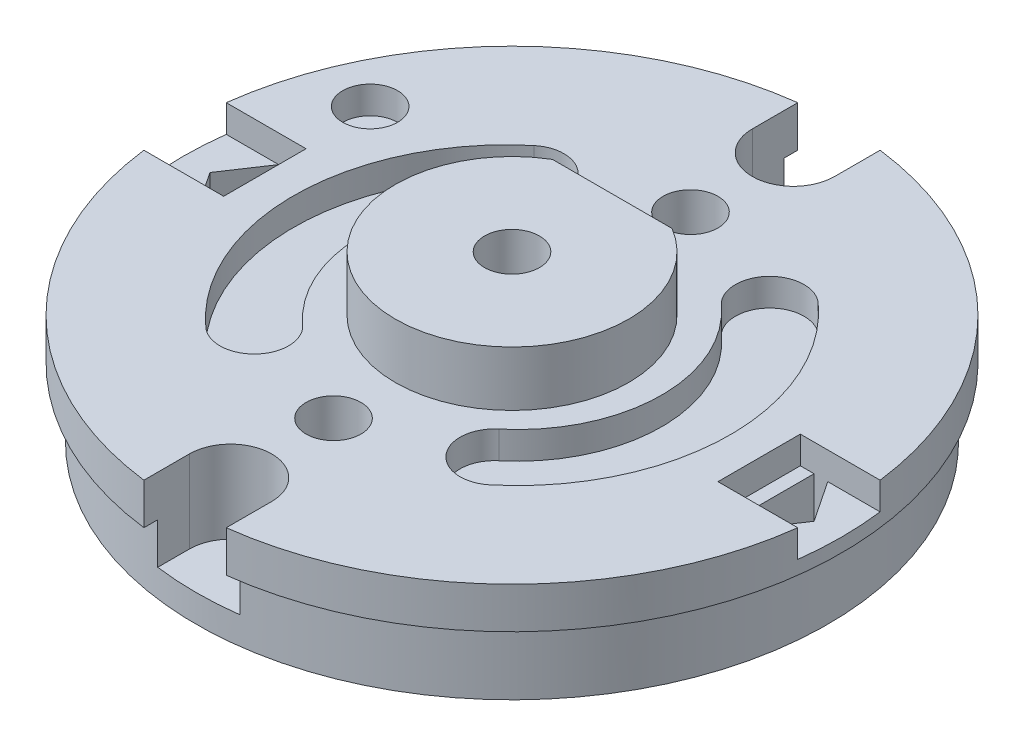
ISO-10303-21;
HEADER;
FILE_DESCRIPTION(('STEP AP214'),'2;1');
FILE_NAME('part.step','',(''),(''),'','','');
FILE_SCHEMA(('AUTOMOTIVE_DESIGN { 1 0 10303 214 1 1 1 1 }'));
ENDSEC;
DATA;
#1=APPLICATION_CONTEXT('core data for automotive mechanical design processes');
#2=APPLICATION_PROTOCOL_DEFINITION('international standard','automotive_design',2000,#1);
#3=PRODUCT_CONTEXT('',#1,'mechanical');
#4=PRODUCT('Part','Part','',(#3));
#5=PRODUCT_RELATED_PRODUCT_CATEGORY('part','',(#4));
#6=PRODUCT_DEFINITION_FORMATION('','',#4);
#7=PRODUCT_DEFINITION_CONTEXT('part definition',#1,'design');
#8=PRODUCT_DEFINITION('design','',#6,#7);
#9=PRODUCT_DEFINITION_SHAPE('','',#8);
#10=(LENGTH_UNIT() NAMED_UNIT(*) SI_UNIT(.MILLI.,.METRE.));
#11=(NAMED_UNIT(*) PLANE_ANGLE_UNIT() SI_UNIT($,.RADIAN.));
#12=(NAMED_UNIT(*) SI_UNIT($,.STERADIAN.) SOLID_ANGLE_UNIT());
#13=UNCERTAINTY_MEASURE_WITH_UNIT(LENGTH_MEASURE(1.E-05),#10,'distance_accuracy_value','');
#14=(GEOMETRIC_REPRESENTATION_CONTEXT(3) GLOBAL_UNCERTAINTY_ASSIGNED_CONTEXT((#13)) GLOBAL_UNIT_ASSIGNED_CONTEXT((#10,
#11,#12)) REPRESENTATION_CONTEXT('',''));
#15=CARTESIAN_POINT('',(0.,0.,0.));
#16=DIRECTION('',(0.,0.,1.));
#17=DIRECTION('',(1.,0.,0.));
#18=AXIS2_PLACEMENT_3D('',#15,#16,#17);
#19=CARTESIAN_POINT('',(9.99999999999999,0.,-1.50000000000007));
#20=DIRECTION('',(0.83205029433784,0.,-0.554700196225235));
#21=DIRECTION('',(-0.554700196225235,0.,-0.83205029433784));
#22=AXIS2_PLACEMENT_3D('',#19,#20,#21);
#23=PLANE('',#22);
#24=DIRECTION('',(0.554700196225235,0.,0.83205029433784));
#25=VECTOR('',#24,1.);
#26=CARTESIAN_POINT('',(9.99999999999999,3.,-1.50000000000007));
#27=LINE('',#26,#25);
#28=CARTESIAN_POINT('',(9.99999999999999,3.,-1.50000000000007));
#29=VERTEX_POINT('',#28);
#30=CARTESIAN_POINT('',(11.,3.,0.));
#31=VERTEX_POINT('',#30);
#32=EDGE_CURVE('E51',#29,#31,#27,.T.);
#33=ORIENTED_EDGE('',*,*,#32,.F.);
#34=DIRECTION('',(0.,1.,0.));
#35=VECTOR('',#34,1.);
#36=CARTESIAN_POINT('',(9.99999999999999,0.,-1.50000000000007));
#37=LINE('',#36,#35);
#38=CARTESIAN_POINT('',(9.99999999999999,0.,-1.50000000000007));
#39=VERTEX_POINT('',#38);
#40=EDGE_CURVE('E351',#39,#29,#37,.T.);
#41=ORIENTED_EDGE('',*,*,#40,.F.);
#42=DIRECTION('',(-0.554700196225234,0.,-0.83205029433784));
#43=VECTOR('',#42,1.);
#44=CARTESIAN_POINT('',(9.99999999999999,0.,-1.50000000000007));
#45=LINE('',#44,#43);
#46=CARTESIAN_POINT('',(11.,0.,0.));
#47=VERTEX_POINT('',#46);
#48=EDGE_CURVE('E335',#47,#39,#45,.T.);
#49=ORIENTED_EDGE('',*,*,#48,.F.);
#50=DIRECTION('',(0.,1.,0.));
#51=VECTOR('',#50,1.);
#52=CARTESIAN_POINT('',(11.,0.,0.));
#53=LINE('',#52,#51);
#54=EDGE_CURVE('E354',#47,#31,#53,.T.);
#55=ORIENTED_EDGE('',*,*,#54,.T.);
#56=EDGE_LOOP('',(#33,#41,#49,#55));
#57=FACE_BOUND('',#56,.T.);
#58=ADVANCED_FACE('F36',(#57),#23,.F.);
#59=CARTESIAN_POINT('',(11.,0.,0.));
#60=DIRECTION('',(0.832050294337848,0.,0.554700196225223));
#61=DIRECTION('',(0.554700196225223,0.,-0.832050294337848));
#62=AXIS2_PLACEMENT_3D('',#59,#60,#61);
#63=PLANE('',#62);
#64=DIRECTION('',(-0.554700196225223,0.,0.832050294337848));
#65=VECTOR('',#64,1.);
#66=CARTESIAN_POINT('',(11.,3.,0.));
#67=LINE('',#66,#65);
#68=CARTESIAN_POINT('',(10.,3.,1.49999999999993));
#69=VERTEX_POINT('',#68);
#70=EDGE_CURVE('E324',#31,#69,#67,.T.);
#71=ORIENTED_EDGE('',*,*,#70,.F.);
#72=ORIENTED_EDGE('',*,*,#54,.F.);
#73=DIRECTION('',(0.554700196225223,0.,-0.832050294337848));
#74=VECTOR('',#73,1.);
#75=CARTESIAN_POINT('',(11.,0.,0.));
#76=LINE('',#75,#74);
#77=CARTESIAN_POINT('',(10.,0.,1.49999999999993));
#78=VERTEX_POINT('',#77);
#79=EDGE_CURVE('E348',#78,#47,#76,.T.);
#80=ORIENTED_EDGE('',*,*,#79,.F.);
#81=DIRECTION('',(0.,1.,0.));
#82=VECTOR('',#81,1.);
#83=CARTESIAN_POINT('',(10.,0.,1.49999999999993));
#84=LINE('',#83,#82);
#85=EDGE_CURVE('E358',#78,#69,#84,.T.);
#86=ORIENTED_EDGE('',*,*,#85,.T.);
#87=EDGE_LOOP('',(#71,#72,#80,#86));
#88=FACE_BOUND('',#87,.T.);
#89=ADVANCED_FACE('F694',(#88),#63,.F.);
#90=CARTESIAN_POINT('',(9.50000000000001,0.,1.49999999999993));
#91=DIRECTION('',(-1.,0.,0.));
#92=DIRECTION('',(0.,0.,1.));
#93=AXIS2_PLACEMENT_3D('',#90,#91,#92);
#94=PLANE('',#93);
#95=DIRECTION('',(0.,0.,-1.));
#96=VECTOR('',#95,1.);
#97=CARTESIAN_POINT('',(9.50000000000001,3.,1.49999999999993));
#98=LINE('',#97,#96);
#99=CARTESIAN_POINT('',(9.50000000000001,3.,1.49999999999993));
#100=VERTEX_POINT('',#99);
#101=CARTESIAN_POINT('',(9.49999999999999,3.,-1.50000000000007));
#102=VERTEX_POINT('',#101);
#103=EDGE_CURVE('E297',#100,#102,#98,.T.);
#104=ORIENTED_EDGE('',*,*,#103,.F.);
#105=DIRECTION('',(0.,1.,0.));
#106=VECTOR('',#105,1.);
#107=CARTESIAN_POINT('',(9.50000000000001,0.,1.49999999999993));
#108=LINE('',#107,#106);
#109=CARTESIAN_POINT('',(9.50000000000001,0.,1.49999999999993));
#110=VERTEX_POINT('',#109);
#111=EDGE_CURVE('E361',#110,#100,#108,.T.);
#112=ORIENTED_EDGE('',*,*,#111,.F.);
#113=DIRECTION('',(0.,0.,1.));
#114=VECTOR('',#113,1.);
#115=CARTESIAN_POINT('',(9.50000000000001,0.,1.49999999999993));
#116=LINE('',#115,#114);
#117=CARTESIAN_POINT('',(9.49999999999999,0.,-1.50000000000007));
#118=VERTEX_POINT('',#117);
#119=EDGE_CURVE('E342',#118,#110,#116,.T.);
#120=ORIENTED_EDGE('',*,*,#119,.F.);
#121=DIRECTION('',(0.,1.,0.));
#122=VECTOR('',#121,1.);
#123=CARTESIAN_POINT('',(9.49999999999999,0.,-1.50000000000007));
#124=LINE('',#123,#122);
#125=EDGE_CURVE('E364',#118,#102,#124,.T.);
#126=ORIENTED_EDGE('',*,*,#125,.T.);
#127=EDGE_LOOP('',(#104,#112,#120,#126));
#128=FACE_BOUND('',#127,.T.);
#129=ADVANCED_FACE('F700',(#128),#94,.F.);
#130=CARTESIAN_POINT('',(0.,0.,0.));
#131=DIRECTION('',(0.,-1.,0.));
#132=DIRECTION('',(0.,0.,-1.));
#133=AXIS2_PLACEMENT_3D('',#130,#131,#132);
#134=CYLINDRICAL_SURFACE('',#133,12.);
#135=CARTESIAN_POINT('',(0.,3.,0.));
#136=DIRECTION('',(0.,1.,0.));
#137=DIRECTION('',(0.,0.,1.));
#138=AXIS2_PLACEMENT_3D('',#135,#136,#137);
#139=CIRCLE('',#138,12.);
#140=CARTESIAN_POINT('',(11.9058808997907,3.,1.49999999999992));
#141=VERTEX_POINT('',#140);
#142=CARTESIAN_POINT('',(11.9058808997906,3.,-1.50000000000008));
#143=VERTEX_POINT('',#142);
#144=EDGE_CURVE('E327',#141,#143,#139,.T.);
#145=ORIENTED_EDGE('',*,*,#144,.F.);
#146=DIRECTION('',(0.,-1.,0.));
#147=VECTOR('',#146,1.);
#148=CARTESIAN_POINT('',(11.9058808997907,0.,1.49999999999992));
#149=LINE('',#148,#147);
#150=CARTESIAN_POINT('',(11.9058808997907,4.,1.49999999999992));
#151=VERTEX_POINT('',#150);
#152=EDGE_CURVE('E332',#141,#151,#149,.F.);
#153=ORIENTED_EDGE('',*,*,#152,.T.);
#154=CARTESIAN_POINT('',(0.,4.,0.));
#155=DIRECTION('',(0.,-1.,0.));
#156=DIRECTION('',(0.,0.,-1.));
#157=AXIS2_PLACEMENT_3D('',#154,#155,#156);
#158=CIRCLE('',#157,12.);
#159=CARTESIAN_POINT('',(1.50000000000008,4.,11.9058808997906));
#160=VERTEX_POINT('',#159);
#161=EDGE_CURVE('E600',#151,#160,#158,.T.);
#162=ORIENTED_EDGE('',*,*,#161,.T.);
#163=DIRECTION('',(0.,-1.,0.));
#164=VECTOR('',#163,1.);
#165=CARTESIAN_POINT('',(1.50000000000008,0.,11.9058808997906));
#166=LINE('',#165,#164);
#167=CARTESIAN_POINT('',(1.50000000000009,2.5,11.9058808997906));
#168=VERTEX_POINT('',#167);
#169=EDGE_CURVE('E395',#160,#168,#166,.T.);
#170=ORIENTED_EDGE('',*,*,#169,.T.);
#171=CARTESIAN_POINT('',(0.,2.5,0.));
#172=DIRECTION('',(0.,-1.,0.));
#173=DIRECTION('',(0.,0.,-1.));
#174=AXIS2_PLACEMENT_3D('',#171,#172,#173);
#175=CIRCLE('',#174,12.);
#176=CARTESIAN_POINT('',(1.5,2.5,-11.9058808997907));
#177=VERTEX_POINT('',#176);
#178=EDGE_CURVE('E592',#177,#168,#175,.T.);
#179=ORIENTED_EDGE('',*,*,#178,.F.);
#180=DIRECTION('',(0.,-1.,0.));
#181=VECTOR('',#180,1.);
#182=CARTESIAN_POINT('',(1.5,0.,-11.9058808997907));
#183=LINE('',#182,#181);
#184=CARTESIAN_POINT('',(1.5,4.,-11.9058808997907));
#185=VERTEX_POINT('',#184);
#186=EDGE_CURVE('E528',#177,#185,#183,.F.);
#187=ORIENTED_EDGE('',*,*,#186,.T.);
#188=CARTESIAN_POINT('',(11.9058808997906,4.,-1.50000000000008));
#189=VERTEX_POINT('',#188);
#190=EDGE_CURVE('E596',#185,#189,#158,.T.);
#191=ORIENTED_EDGE('',*,*,#190,.T.);
#192=DIRECTION('',(0.,-1.,0.));
#193=VECTOR('',#192,1.);
#194=CARTESIAN_POINT('',(11.9058808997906,0.,-1.50000000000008));
#195=LINE('',#194,#193);
#196=EDGE_CURVE('E329',#189,#143,#195,.T.);
#197=ORIENTED_EDGE('',*,*,#196,.T.);
#198=EDGE_LOOP('',(#145,#153,#162,#170,#179,#187,#191,#197));
#199=FACE_BOUND('',#198,.T.);
#200=ADVANCED_FACE('F663',(#199),#134,.T.);
#201=CARTESIAN_POINT('',(-12.,2.5,0.));
#202=DIRECTION('',(0.,1.,0.));
#203=DIRECTION('',(0.,0.,1.));
#204=AXIS2_PLACEMENT_3D('',#201,#202,#203);
#205=PLANE('',#204);
#206=ORIENTED_EDGE('',*,*,#178,.T.);
#207=DIRECTION('',(0.,0.,-1.));
#208=VECTOR('',#207,1.);
#209=CARTESIAN_POINT('',(1.5,2.5,0.));
#210=LINE('',#209,#208);
#211=CARTESIAN_POINT('',(1.50000000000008,2.5,11.4017542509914));
#212=VERTEX_POINT('',#211);
#213=EDGE_CURVE('E392',#168,#212,#210,.T.);
#214=ORIENTED_EDGE('',*,*,#213,.T.);
#215=CARTESIAN_POINT('',(0.,2.5,0.));
#216=DIRECTION('',(0.,-1.,0.));
#217=DIRECTION('',(0.,0.,-1.));
#218=AXIS2_PLACEMENT_3D('',#215,#216,#217);
#219=CIRCLE('',#218,11.5);
#220=CARTESIAN_POINT('',(1.5,2.5,-11.4017542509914));
#221=VERTEX_POINT('',#220);
#222=EDGE_CURVE('E588',#221,#212,#219,.T.);
#223=ORIENTED_EDGE('',*,*,#222,.F.);
#224=DIRECTION('',(0.,0.,-1.));
#225=VECTOR('',#224,1.);
#226=CARTESIAN_POINT('',(1.5,2.5,0.));
#227=LINE('',#226,#225);
#228=EDGE_CURVE('E524',#221,#177,#227,.T.);
#229=ORIENTED_EDGE('',*,*,#228,.T.);
#230=EDGE_LOOP('',(#206,#214,#223,#229));
#231=FACE_BOUND('',#230,.T.);
#232=ADVANCED_FACE('F681',(#231),#205,.F.);
#233=CARTESIAN_POINT('',(-8.5,2.5,0.));
#234=DIRECTION('',(0.,1.,0.));
#235=DIRECTION('',(0.,0.,1.));
#236=AXIS2_PLACEMENT_3D('',#233,#234,#235);
#237=PLANE('',#236);
#238=CARTESIAN_POINT('',(0.,2.5,-6.5));
#239=DIRECTION('',(0.,1.,0.));
#240=DIRECTION('',(0.,0.,1.));
#241=AXIS2_PLACEMENT_3D('',#238,#239,#240);
#242=CIRCLE('',#241,1.);
#243=CARTESIAN_POINT('',(0.,2.5,-5.5));
#244=VERTEX_POINT('',#243);
#245=EDGE_CURVE('E575',#244,#244,#242,.F.);
#246=ORIENTED_EDGE('',*,*,#245,.F.);
#247=EDGE_LOOP('',(#246));
#248=FACE_BOUND('',#247,.T.);
#249=CARTESIAN_POINT('',(0.,2.5,0.));
#250=DIRECTION('',(0.,-1.,0.));
#251=DIRECTION('',(0.,0.,-1.));
#252=AXIS2_PLACEMENT_3D('',#249,#250,#251);
#253=CIRCLE('',#252,1.);
#254=CARTESIAN_POINT('',(0.,2.5,-1.));
#255=VERTEX_POINT('',#254);
#256=EDGE_CURVE('E609',#255,#255,#253,.T.);
#257=ORIENTED_EDGE('',*,*,#256,.F.);
#258=EDGE_LOOP('',(#257));
#259=FACE_BOUND('',#258,.T.);
#260=CARTESIAN_POINT('',(0.,2.5,0.));
#261=DIRECTION('',(0.,-1.,0.));
#262=DIRECTION('',(0.,0.,-1.));
#263=AXIS2_PLACEMENT_3D('',#260,#261,#262);
#264=CIRCLE('',#263,8.5);
#265=CARTESIAN_POINT('',(0.,2.5,-8.5));
#266=VERTEX_POINT('',#265);
#267=EDGE_CURVE('E578',#266,#266,#264,.T.);
#268=ORIENTED_EDGE('',*,*,#267,.T.);
#269=EDGE_LOOP('',(#268));
#270=FACE_BOUND('',#269,.T.);
#271=CARTESIAN_POINT('',(0.,2.5,6.5));
#272=DIRECTION('',(0.,1.,0.));
#273=DIRECTION('',(0.,0.,1.));
#274=AXIS2_PLACEMENT_3D('',#271,#272,#273);
#275=CIRCLE('',#274,1.);
#276=CARTESIAN_POINT('',(0.,2.5,7.5));
#277=VERTEX_POINT('',#276);
#278=EDGE_CURVE('E431',#277,#277,#275,.F.);
#279=ORIENTED_EDGE('',*,*,#278,.F.);
#280=EDGE_LOOP('',(#279));
#281=FACE_BOUND('',#280,.T.);
#282=ADVANCED_FACE('F38',(#248,#259,#270,#281),#237,.F.);
#283=CARTESIAN_POINT('',(-4.25,4.,0.));
#284=DIRECTION('',(0.,-1.,0.));
#285=DIRECTION('',(0.,0.,-1.));
#286=AXIS2_PLACEMENT_3D('',#283,#284,#285);
#287=PLANE('',#286);
#288=ORIENTED_EDGE('',*,*,#161,.F.);
#289=DIRECTION('',(1.,0.,0.));
#290=VECTOR('',#289,1.);
#291=CARTESIAN_POINT('',(10.,4.,1.49999999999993));
#292=LINE('',#291,#290);
#293=CARTESIAN_POINT('',(9.00000000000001,4.,1.49999999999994));
#294=VERTEX_POINT('',#293);
#295=EDGE_CURVE('E339',#294,#151,#292,.T.);
#296=ORIENTED_EDGE('',*,*,#295,.F.);
#297=DIRECTION('',(0.,0.,1.));
#298=VECTOR('',#297,1.);
#299=CARTESIAN_POINT('',(9.00000000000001,4.,1.49999999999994));
#300=LINE('',#299,#298);
#301=CARTESIAN_POINT('',(8.99999999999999,4.,-1.50000000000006));
#302=VERTEX_POINT('',#301);
#303=EDGE_CURVE('E302',#302,#294,#300,.T.);
#304=ORIENTED_EDGE('',*,*,#303,.F.);
#305=DIRECTION('',(-1.,0.,0.));
#306=VECTOR('',#305,1.);
#307=CARTESIAN_POINT('',(9.49999999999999,4.,-1.50000000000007));
#308=LINE('',#307,#306);
#309=EDGE_CURVE('E308',#189,#302,#308,.T.);
#310=ORIENTED_EDGE('',*,*,#309,.F.);
#311=ORIENTED_EDGE('',*,*,#190,.F.);
#312=DIRECTION('',(0.,0.,-1.));
#313=VECTOR('',#312,1.);
#314=CARTESIAN_POINT('',(1.5,4.,-15.));
#315=LINE('',#314,#313);
#316=CARTESIAN_POINT('',(1.5,4.,-10.25));
#317=VERTEX_POINT('',#316);
#318=EDGE_CURVE('E518',#317,#185,#315,.T.);
#319=ORIENTED_EDGE('',*,*,#318,.F.);
#320=CARTESIAN_POINT('',(0.,4.,-10.25));
#321=DIRECTION('',(0.,1.,0.));
#322=DIRECTION('',(0.,0.,-1.));
#323=AXIS2_PLACEMENT_3D('',#320,#321,#322);
#324=CIRCLE('',#323,1.5);
#325=CARTESIAN_POINT('',(-1.5,4.,-10.25));
#326=VERTEX_POINT('',#325);
#327=EDGE_CURVE('E495',#326,#317,#324,.T.);
#328=ORIENTED_EDGE('',*,*,#327,.F.);
#329=DIRECTION('',(0.,0.,1.));
#330=VECTOR('',#329,1.);
#331=CARTESIAN_POINT('',(-1.5,4.,-10.25));
#332=LINE('',#331,#330);
#333=CARTESIAN_POINT('',(-1.5,4.,-11.9058808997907));
#334=VERTEX_POINT('',#333);
#335=EDGE_CURVE('E511',#334,#326,#332,.T.);
#336=ORIENTED_EDGE('',*,*,#335,.F.);
#337=CARTESIAN_POINT('',(-11.9058808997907,4.,-1.5));
#338=VERTEX_POINT('',#337);
#339=EDGE_CURVE('E595',#338,#334,#158,.T.);
#340=ORIENTED_EDGE('',*,*,#339,.F.);
#341=DIRECTION('',(-1.,0.,0.));
#342=VECTOR('',#341,1.);
#343=CARTESIAN_POINT('',(-10.,4.,-1.5));
#344=LINE('',#343,#342);
#345=CARTESIAN_POINT('',(-9.,4.,-1.5));
#346=VERTEX_POINT('',#345);
#347=EDGE_CURVE('E477',#346,#338,#344,.T.);
#348=ORIENTED_EDGE('',*,*,#347,.F.);
#349=DIRECTION('',(0.,0.,-1.));
#350=VECTOR('',#349,1.);
#351=CARTESIAN_POINT('',(-9.,4.,-1.5));
#352=LINE('',#351,#350);
#353=CARTESIAN_POINT('',(-9.,4.,1.5));
#354=VERTEX_POINT('',#353);
#355=EDGE_CURVE('E438',#354,#346,#352,.T.);
#356=ORIENTED_EDGE('',*,*,#355,.F.);
#357=DIRECTION('',(1.,0.,0.));
#358=VECTOR('',#357,1.);
#359=CARTESIAN_POINT('',(-9.5,4.,1.5));
#360=LINE('',#359,#358);
#361=CARTESIAN_POINT('',(-11.9058808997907,4.,1.5));
#362=VERTEX_POINT('',#361);
#363=EDGE_CURVE('E472',#362,#354,#360,.T.);
#364=ORIENTED_EDGE('',*,*,#363,.F.);
#365=CARTESIAN_POINT('',(-1.49999999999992,4.,11.9058808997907));
#366=VERTEX_POINT('',#365);
#367=EDGE_CURVE('E656',#366,#362,#158,.T.);
#368=ORIENTED_EDGE('',*,*,#367,.F.);
#369=DIRECTION('',(0.,0.,1.));
#370=VECTOR('',#369,1.);
#371=CARTESIAN_POINT('',(-1.49999999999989,4.,15.));
#372=LINE('',#371,#370);
#373=CARTESIAN_POINT('',(-1.49999999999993,4.,10.25));
#374=VERTEX_POINT('',#373);
#375=EDGE_CURVE('E379',#374,#366,#372,.T.);
#376=ORIENTED_EDGE('',*,*,#375,.F.);
#377=CARTESIAN_POINT('',(0.,4.,10.25));
#378=DIRECTION('',(0.,1.,0.));
#379=DIRECTION('',(0.,0.,1.));
#380=AXIS2_PLACEMENT_3D('',#377,#378,#379);
#381=CIRCLE('',#380,1.5);
#382=CARTESIAN_POINT('',(1.50000000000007,4.,10.25));
#383=VERTEX_POINT('',#382);
#384=EDGE_CURVE('E357',#383,#374,#381,.T.);
#385=ORIENTED_EDGE('',*,*,#384,.F.);
#386=DIRECTION('',(0.,0.,-1.));
#387=VECTOR('',#386,1.);
#388=CARTESIAN_POINT('',(1.50000000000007,4.,10.25));
#389=LINE('',#388,#387);
#390=EDGE_CURVE('E372',#160,#383,#389,.T.);
#391=ORIENTED_EDGE('',*,*,#390,.F.);
#392=EDGE_LOOP('',(#288,#296,#304,#310,#311,#319,#328,#336,#340,#348,#356,#364,#368,#376,#385,#391));
#393=FACE_BOUND('',#392,.T.);
#394=CARTESIAN_POINT('',(-0.00282444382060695,4.,-0.208431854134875));
#395=DIRECTION('',(0.,1.,0.));
#396=DIRECTION('',(0.,0.,-1.));
#397=AXIS2_PLACEMENT_3D('',#394,#395,#396);
#398=CIRCLE('',#397,7.75);
#399=CARTESIAN_POINT('',(4.94917231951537,4.,5.75313069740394));
#400=VERTEX_POINT('',#399);
#401=CARTESIAN_POINT('',(5.18767943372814,4.,-5.96353128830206));
#402=VERTEX_POINT('',#401);
#403=EDGE_CURVE('E414',#400,#402,#398,.T.);
#404=ORIENTED_EDGE('',*,*,#403,.F.);
#405=CARTESIAN_POINT('',(4.1504631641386,4.,4.79158835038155));
#406=DIRECTION('',(0.,1.,0.));
#407=DIRECTION('',(0.,0.,1.));
#408=AXIS2_PLACEMENT_3D('',#405,#406,#407);
#409=CIRCLE('',#408,1.25);
#410=CARTESIAN_POINT('',(3.35175400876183,4.,3.83004600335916));
#411=VERTEX_POINT('',#410);
#412=EDGE_CURVE('E398',#411,#400,#409,.T.);
#413=ORIENTED_EDGE('',*,*,#412,.F.);
#414=CARTESIAN_POINT('',(-0.00282444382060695,4.,-0.208431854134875));
#415=DIRECTION('',(0.,-1.,0.));
#416=DIRECTION('',(0.,0.,-1.));
#417=AXIS2_PLACEMENT_3D('',#414,#415,#416);
#418=CIRCLE('',#417,5.25);
#419=CARTESIAN_POINT('',(3.51332334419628,4.,-4.10704759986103));
#420=VERTEX_POINT('',#419);
#421=EDGE_CURVE('E403',#420,#411,#418,.T.);
#422=ORIENTED_EDGE('',*,*,#421,.F.);
#423=CARTESIAN_POINT('',(4.35050138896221,4.,-5.03528944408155));
#424=DIRECTION('',(0.,1.,0.));
#425=DIRECTION('',(0.,0.,1.));
#426=AXIS2_PLACEMENT_3D('',#423,#424,#425);
#427=CIRCLE('',#426,1.25);
#428=EDGE_CURVE('E417',#402,#420,#427,.T.);
#429=ORIENTED_EDGE('',*,*,#428,.F.);
#430=EDGE_LOOP('',(#404,#413,#422,#429));
#431=FACE_BOUND('',#430,.T.);
#432=CARTESIAN_POINT('',(0.,4.,-6.5));
#433=DIRECTION('',(0.,-1.,0.));
#434=DIRECTION('',(0.,0.,-1.));
#435=AXIS2_PLACEMENT_3D('',#432,#433,#434);
#436=CIRCLE('',#435,1.);
#437=CARTESIAN_POINT('',(0.,4.,-7.5));
#438=VERTEX_POINT('',#437);
#439=EDGE_CURVE('E574',#438,#438,#436,.F.);
#440=ORIENTED_EDGE('',*,*,#439,.F.);
#441=EDGE_LOOP('',(#440));
#442=FACE_BOUND('',#441,.T.);
#443=DIRECTION('',(1.,0.,0.));
#444=VECTOR('',#443,1.);
#445=CARTESIAN_POINT('',(-12.,4.,-3.65));
#446=LINE('',#445,#444);
#447=CARTESIAN_POINT('',(-2.17715410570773,4.,-3.65));
#448=VERTEX_POINT('',#447);
#449=CARTESIAN_POINT('',(2.17715410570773,4.,-3.65));
#450=VERTEX_POINT('',#449);
#451=EDGE_CURVE('E563',#448,#450,#446,.T.);
#452=ORIENTED_EDGE('',*,*,#451,.T.);
#453=CARTESIAN_POINT('',(0.,4.,0.));
#454=DIRECTION('',(0.,-1.,0.));
#455=DIRECTION('',(0.,0.,-1.));
#456=AXIS2_PLACEMENT_3D('',#453,#454,#455);
#457=CIRCLE('',#456,4.25);
#458=EDGE_CURVE('E599',#450,#448,#457,.T.);
#459=ORIENTED_EDGE('',*,*,#458,.T.);
#460=EDGE_LOOP('',(#452,#459));
#461=FACE_BOUND('',#460,.T.);
#462=CARTESIAN_POINT('',(0.0028244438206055,4.,0.208431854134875));
#463=DIRECTION('',(0.,1.,0.));
#464=DIRECTION('',(0.,0.,1.));
#465=AXIS2_PLACEMENT_3D('',#462,#463,#464);
#466=CIRCLE('',#465,7.75);
#467=CARTESIAN_POINT('',(-4.94917231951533,4.,-5.75313069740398));
#468=VERTEX_POINT('',#467);
#469=CARTESIAN_POINT('',(-5.18767943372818,4.,5.96353128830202));
#470=VERTEX_POINT('',#469);
#471=EDGE_CURVE('E553',#468,#470,#466,.T.);
#472=ORIENTED_EDGE('',*,*,#471,.F.);
#473=CARTESIAN_POINT('',(-4.15046316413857,4.,-4.79158835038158));
#474=DIRECTION('',(0.,1.,0.));
#475=DIRECTION('',(0.,0.,-1.));
#476=AXIS2_PLACEMENT_3D('',#473,#474,#475);
#477=CIRCLE('',#476,1.25);
#478=CARTESIAN_POINT('',(-3.3517540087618,4.,-3.83004600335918));
#479=VERTEX_POINT('',#478);
#480=EDGE_CURVE('E537',#479,#468,#477,.T.);
#481=ORIENTED_EDGE('',*,*,#480,.F.);
#482=CARTESIAN_POINT('',(0.0028244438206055,4.,0.208431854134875));
#483=DIRECTION('',(0.,-1.,0.));
#484=DIRECTION('',(0.,0.,1.));
#485=AXIS2_PLACEMENT_3D('',#482,#483,#484);
#486=CIRCLE('',#485,5.25);
#487=CARTESIAN_POINT('',(-3.51332334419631,4.,4.10704759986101));
#488=VERTEX_POINT('',#487);
#489=EDGE_CURVE('E542',#488,#479,#486,.T.);
#490=ORIENTED_EDGE('',*,*,#489,.F.);
#491=CARTESIAN_POINT('',(-4.35050138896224,4.,5.03528944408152));
#492=DIRECTION('',(0.,1.,0.));
#493=DIRECTION('',(0.,0.,-1.));
#494=AXIS2_PLACEMENT_3D('',#491,#492,#493);
#495=CIRCLE('',#494,1.25);
#496=EDGE_CURVE('E556',#470,#488,#495,.T.);
#497=ORIENTED_EDGE('',*,*,#496,.F.);
#498=EDGE_LOOP('',(#472,#481,#490,#497));
#499=FACE_BOUND('',#498,.T.);
#500=CARTESIAN_POINT('',(-9.16515138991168,4.,-4.));
#501=DIRECTION('',(0.,1.,0.));
#502=DIRECTION('',(0.,0.,1.));
#503=AXIS2_PLACEMENT_3D('',#500,#501,#502);
#504=CIRCLE('',#503,1.);
#505=CARTESIAN_POINT('',(-9.16515138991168,4.,-3.));
#506=VERTEX_POINT('',#505);
#507=EDGE_CURVE('E434',#506,#506,#504,.T.);
#508=ORIENTED_EDGE('',*,*,#507,.F.);
#509=EDGE_LOOP('',(#508));
#510=FACE_BOUND('',#509,.T.);
#511=CARTESIAN_POINT('',(0.,4.,6.5));
#512=DIRECTION('',(0.,-1.,0.));
#513=DIRECTION('',(0.,0.,-1.));
#514=AXIS2_PLACEMENT_3D('',#511,#512,#513);
#515=CIRCLE('',#514,1.);
#516=CARTESIAN_POINT('',(0.,4.,5.5));
#517=VERTEX_POINT('',#516);
#518=EDGE_CURVE('E424',#517,#517,#515,.F.);
#519=ORIENTED_EDGE('',*,*,#518,.F.);
#520=EDGE_LOOP('',(#519));
#521=FACE_BOUND('',#520,.T.);
#522=ADVANCED_FACE('F670',(#393,#431,#442,#461,#499,#510,#521),#287,.F.);
#523=CARTESIAN_POINT('',(-10.,0.,1.5));
#524=DIRECTION('',(-0.832050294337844,0.,0.554700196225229));
#525=DIRECTION('',(0.554700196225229,0.,0.832050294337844));
#526=AXIS2_PLACEMENT_3D('',#523,#524,#525);
#527=PLANE('',#526);
#528=DIRECTION('',(-0.554700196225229,0.,-0.832050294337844));
#529=VECTOR('',#528,1.);
#530=CARTESIAN_POINT('',(-10.,3.,1.5));
#531=LINE('',#530,#529);
#532=CARTESIAN_POINT('',(-10.,3.,1.5));
#533=VERTEX_POINT('',#532);
#534=CARTESIAN_POINT('',(-11.,3.,0.));
#535=VERTEX_POINT('',#534);
#536=EDGE_CURVE('E462',#533,#535,#531,.T.);
#537=ORIENTED_EDGE('',*,*,#536,.F.);
#538=DIRECTION('',(0.,1.,0.));
#539=VECTOR('',#538,1.);
#540=CARTESIAN_POINT('',(-10.,0.,1.5));
#541=LINE('',#540,#539);
#542=CARTESIAN_POINT('',(-10.,0.,1.5));
#543=VERTEX_POINT('',#542);
#544=EDGE_CURVE('E489',#543,#533,#541,.T.);
#545=ORIENTED_EDGE('',*,*,#544,.F.);
#546=DIRECTION('',(0.554700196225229,0.,0.832050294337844));
#547=VECTOR('',#546,1.);
#548=CARTESIAN_POINT('',(-10.,0.,1.5));
#549=LINE('',#548,#547);
#550=CARTESIAN_POINT('',(-11.,0.,0.));
#551=VERTEX_POINT('',#550);
#552=EDGE_CURVE('E473',#551,#543,#549,.T.);
#553=ORIENTED_EDGE('',*,*,#552,.F.);
#554=DIRECTION('',(0.,1.,0.));
#555=VECTOR('',#554,1.);
#556=CARTESIAN_POINT('',(-11.,0.,0.));
#557=LINE('',#556,#555);
#558=EDGE_CURVE('E492',#551,#535,#557,.T.);
#559=ORIENTED_EDGE('',*,*,#558,.T.);
#560=EDGE_LOOP('',(#537,#545,#553,#559));
#561=FACE_BOUND('',#560,.T.);
#562=ADVANCED_FACE('F767',(#561),#527,.F.);
#563=CARTESIAN_POINT('',(-11.,0.,0.));
#564=DIRECTION('',(-0.832050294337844,0.,-0.554700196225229));
#565=DIRECTION('',(-0.554700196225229,0.,0.832050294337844));
#566=AXIS2_PLACEMENT_3D('',#563,#564,#565);
#567=PLANE('',#566);
#568=DIRECTION('',(0.554700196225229,0.,-0.832050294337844));
#569=VECTOR('',#568,1.);
#570=CARTESIAN_POINT('',(-11.,3.,0.));
#571=LINE('',#570,#569);
#572=CARTESIAN_POINT('',(-10.,3.,-1.5));
#573=VERTEX_POINT('',#572);
#574=EDGE_CURVE('E460',#535,#573,#571,.T.);
#575=ORIENTED_EDGE('',*,*,#574,.F.);
#576=ORIENTED_EDGE('',*,*,#558,.F.);
#577=DIRECTION('',(-0.554700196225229,0.,0.832050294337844));
#578=VECTOR('',#577,1.);
#579=CARTESIAN_POINT('',(-11.,0.,0.));
#580=LINE('',#579,#578);
#581=CARTESIAN_POINT('',(-10.,0.,-1.5));
#582=VERTEX_POINT('',#581);
#583=EDGE_CURVE('E486',#582,#551,#580,.T.);
#584=ORIENTED_EDGE('',*,*,#583,.F.);
#585=DIRECTION('',(0.,1.,0.));
#586=VECTOR('',#585,1.);
#587=CARTESIAN_POINT('',(-10.,0.,-1.5));
#588=LINE('',#587,#586);
#589=EDGE_CURVE('E496',#582,#573,#588,.T.);
#590=ORIENTED_EDGE('',*,*,#589,.T.);
#591=EDGE_LOOP('',(#575,#576,#584,#590));
#592=FACE_BOUND('',#591,.T.);
#593=ADVANCED_FACE('F763',(#592),#567,.F.);
#594=CARTESIAN_POINT('',(-9.5,0.,-1.5));
#595=DIRECTION('',(1.,0.,0.));
#596=DIRECTION('',(0.,0.,-1.));
#597=AXIS2_PLACEMENT_3D('',#594,#595,#596);
#598=PLANE('',#597);
#599=DIRECTION('',(0.,0.,1.));
#600=VECTOR('',#599,1.);
#601=CARTESIAN_POINT('',(-9.5,3.,-1.5));
#602=LINE('',#601,#600);
#603=CARTESIAN_POINT('',(-9.5,3.,-1.5));
#604=VERTEX_POINT('',#603);
#605=CARTESIAN_POINT('',(-9.5,3.,1.5));
#606=VERTEX_POINT('',#605);
#607=EDGE_CURVE('E456',#604,#606,#602,.T.);
#608=ORIENTED_EDGE('',*,*,#607,.F.);
#609=DIRECTION('',(0.,1.,0.));
#610=VECTOR('',#609,1.);
#611=CARTESIAN_POINT('',(-9.5,0.,-1.5));
#612=LINE('',#611,#610);
#613=CARTESIAN_POINT('',(-9.5,0.,-1.5));
#614=VERTEX_POINT('',#613);
#615=EDGE_CURVE('E499',#614,#604,#612,.T.);
#616=ORIENTED_EDGE('',*,*,#615,.F.);
#617=DIRECTION('',(0.,0.,-1.));
#618=VECTOR('',#617,1.);
#619=CARTESIAN_POINT('',(-9.5,0.,-1.5));
#620=LINE('',#619,#618);
#621=CARTESIAN_POINT('',(-9.5,0.,1.5));
#622=VERTEX_POINT('',#621);
#623=EDGE_CURVE('E480',#622,#614,#620,.T.);
#624=ORIENTED_EDGE('',*,*,#623,.F.);
#625=DIRECTION('',(0.,1.,0.));
#626=VECTOR('',#625,1.);
#627=CARTESIAN_POINT('',(-9.5,0.,1.5));
#628=LINE('',#627,#626);
#629=EDGE_CURVE('E502',#622,#606,#628,.T.);
#630=ORIENTED_EDGE('',*,*,#629,.T.);
#631=EDGE_LOOP('',(#608,#616,#624,#630));
#632=FACE_BOUND('',#631,.T.);
#633=ADVANCED_FACE('F766',(#632),#598,.F.);
#634=CARTESIAN_POINT('',(0.,0.,0.));
#635=DIRECTION('',(0.,-1.,0.));
#636=DIRECTION('',(0.,0.,-1.));
#637=AXIS2_PLACEMENT_3D('',#634,#635,#636);
#638=CYLINDRICAL_SURFACE('',#637,1.);
#639=CARTESIAN_POINT('',(0.,6.,0.));
#640=DIRECTION('',(0.,-1.,0.));
#641=DIRECTION('',(0.,0.,-1.));
#642=AXIS2_PLACEMENT_3D('',#639,#640,#641);
#643=CIRCLE('',#642,1.);
#644=CARTESIAN_POINT('',(0.,6.,-1.));
#645=VERTEX_POINT('',#644);
#646=EDGE_CURVE('E606',#645,#645,#643,.T.);
#647=ORIENTED_EDGE('',*,*,#646,.F.);
#648=EDGE_LOOP('',(#647));
#649=FACE_BOUND('',#648,.T.);
#650=ORIENTED_EDGE('',*,*,#256,.T.);
#651=EDGE_LOOP('',(#650));
#652=FACE_BOUND('',#651,.T.);
#653=ADVANCED_FACE('F777',(#649,#652),#638,.F.);
#654=CARTESIAN_POINT('',(-1.,6.,0.));
#655=DIRECTION('',(0.,-1.,0.));
#656=DIRECTION('',(0.,0.,-1.));
#657=AXIS2_PLACEMENT_3D('',#654,#655,#656);
#658=PLANE('',#657);
#659=CARTESIAN_POINT('',(0.,6.,0.));
#660=DIRECTION('',(0.,-1.,0.));
#661=DIRECTION('',(0.,0.,-1.));
#662=AXIS2_PLACEMENT_3D('',#659,#660,#661);
#663=CIRCLE('',#662,4.25);
#664=CARTESIAN_POINT('',(2.17715410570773,6.,-3.65));
#665=VERTEX_POINT('',#664);
#666=CARTESIAN_POINT('',(-2.17715410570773,6.,-3.65));
#667=VERTEX_POINT('',#666);
#668=EDGE_CURVE('E603',#665,#667,#663,.T.);
#669=ORIENTED_EDGE('',*,*,#668,.F.);
#670=DIRECTION('',(-1.,0.,0.));
#671=VECTOR('',#670,1.);
#672=CARTESIAN_POINT('',(-1.,6.,-3.65));
#673=LINE('',#672,#671);
#674=EDGE_CURVE('E571',#665,#667,#673,.T.);
#675=ORIENTED_EDGE('',*,*,#674,.T.);
#676=EDGE_LOOP('',(#669,#675));
#677=FACE_BOUND('',#676,.T.);
#678=ORIENTED_EDGE('',*,*,#646,.T.);
#679=EDGE_LOOP('',(#678));
#680=FACE_BOUND('',#679,.T.);
#681=ADVANCED_FACE('F842',(#677,#680),#658,.F.);
#682=CARTESIAN_POINT('',(0.,0.,0.));
#683=DIRECTION('',(0.,-1.,0.));
#684=DIRECTION('',(0.,0.,-1.));
#685=AXIS2_PLACEMENT_3D('',#682,#683,#684);
#686=CYLINDRICAL_SURFACE('',#685,4.25);
#687=ORIENTED_EDGE('',*,*,#668,.T.);
#688=DIRECTION('',(0.,-1.,0.));
#689=VECTOR('',#688,1.);
#690=CARTESIAN_POINT('',(-2.17715410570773,0.,-3.65));
#691=LINE('',#690,#689);
#692=EDGE_CURVE('E617',#667,#448,#691,.T.);
#693=ORIENTED_EDGE('',*,*,#692,.T.);
#694=ORIENTED_EDGE('',*,*,#458,.F.);
#695=DIRECTION('',(0.,-1.,0.));
#696=VECTOR('',#695,1.);
#697=CARTESIAN_POINT('',(2.17715410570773,0.,-3.65));
#698=LINE('',#697,#696);
#699=EDGE_CURVE('E612',#450,#665,#698,.F.);
#700=ORIENTED_EDGE('',*,*,#699,.T.);
#701=EDGE_LOOP('',(#687,#693,#694,#700));
#702=FACE_BOUND('',#701,.T.);
#703=ADVANCED_FACE('F837',(#702),#686,.T.);
#704=CARTESIAN_POINT('',(-1.49999999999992,2.5,11.9058808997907));
#705=VERTEX_POINT('',#704);
#706=CARTESIAN_POINT('',(-1.5,2.5,-11.9058808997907));
#707=VERTEX_POINT('',#706);
#708=EDGE_CURVE('E591',#705,#707,#175,.T.);
#709=ORIENTED_EDGE('',*,*,#708,.F.);
#710=DIRECTION('',(0.,-1.,0.));
#711=VECTOR('',#710,1.);
#712=CARTESIAN_POINT('',(-1.49999999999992,0.,11.9058808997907));
#713=LINE('',#712,#711);
#714=EDGE_CURVE('E389',#705,#366,#713,.F.);
#715=ORIENTED_EDGE('',*,*,#714,.T.);
#716=ORIENTED_EDGE('',*,*,#367,.T.);
#717=DIRECTION('',(0.,-1.,0.));
#718=VECTOR('',#717,1.);
#719=CARTESIAN_POINT('',(-11.9058808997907,0.,1.5));
#720=LINE('',#719,#718);
#721=CARTESIAN_POINT('',(-11.9058808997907,3.,1.5));
#722=VERTEX_POINT('',#721);
#723=EDGE_CURVE('E466',#362,#722,#720,.T.);
#724=ORIENTED_EDGE('',*,*,#723,.T.);
#725=CARTESIAN_POINT('',(0.,3.,0.));
#726=DIRECTION('',(0.,1.,0.));
#727=DIRECTION('',(0.,0.,1.));
#728=AXIS2_PLACEMENT_3D('',#725,#726,#727);
#729=CIRCLE('',#728,12.);
#730=CARTESIAN_POINT('',(-11.9058808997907,3.,-1.5));
#731=VERTEX_POINT('',#730);
#732=EDGE_CURVE('E464',#731,#722,#729,.T.);
#733=ORIENTED_EDGE('',*,*,#732,.F.);
#734=DIRECTION('',(0.,-1.,0.));
#735=VECTOR('',#734,1.);
#736=CARTESIAN_POINT('',(-11.9058808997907,0.,-1.5));
#737=LINE('',#736,#735);
#738=EDGE_CURVE('E469',#731,#338,#737,.F.);
#739=ORIENTED_EDGE('',*,*,#738,.T.);
#740=ORIENTED_EDGE('',*,*,#339,.T.);
#741=DIRECTION('',(0.,-1.,0.));
#742=VECTOR('',#741,1.);
#743=CARTESIAN_POINT('',(-1.5,0.,-11.9058808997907));
#744=LINE('',#743,#742);
#745=EDGE_CURVE('E534',#334,#707,#744,.T.);
#746=ORIENTED_EDGE('',*,*,#745,.T.);
#747=EDGE_LOOP('',(#709,#715,#716,#724,#733,#739,#740,#746));
#748=FACE_BOUND('',#747,.T.);
#749=ADVANCED_FACE('F652',(#748),#134,.T.);
#750=CARTESIAN_POINT('',(-1.49999999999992,2.5,11.4017542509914));
#751=VERTEX_POINT('',#750);
#752=CARTESIAN_POINT('',(-1.5,2.5,-11.4017542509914));
#753=VERTEX_POINT('',#752);
#754=EDGE_CURVE('E587',#751,#753,#219,.T.);
#755=ORIENTED_EDGE('',*,*,#754,.F.);
#756=DIRECTION('',(0.,0.,1.));
#757=VECTOR('',#756,1.);
#758=CARTESIAN_POINT('',(-1.5,2.5,0.));
#759=LINE('',#758,#757);
#760=EDGE_CURVE('E385',#751,#705,#759,.T.);
#761=ORIENTED_EDGE('',*,*,#760,.T.);
#762=ORIENTED_EDGE('',*,*,#708,.T.);
#763=DIRECTION('',(0.,0.,1.));
#764=VECTOR('',#763,1.);
#765=CARTESIAN_POINT('',(-1.5,2.5,0.));
#766=LINE('',#765,#764);
#767=EDGE_CURVE('E531',#707,#753,#766,.T.);
#768=ORIENTED_EDGE('',*,*,#767,.T.);
#769=EDGE_LOOP('',(#755,#761,#762,#768));
#770=FACE_BOUND('',#769,.T.);
#771=ADVANCED_FACE('F643',(#770),#205,.F.);
#772=CARTESIAN_POINT('',(0.,0.,0.));
#773=DIRECTION('',(0.,-1.,0.));
#774=DIRECTION('',(0.,0.,-1.));
#775=AXIS2_PLACEMENT_3D('',#772,#773,#774);
#776=CYLINDRICAL_SURFACE('',#775,11.5);
#777=ORIENTED_EDGE('',*,*,#222,.T.);
#778=DIRECTION('',(0.,-1.,0.));
#779=VECTOR('',#778,1.);
#780=CARTESIAN_POINT('',(1.50000000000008,0.,11.4017542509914));
#781=LINE('',#780,#779);
#782=CARTESIAN_POINT('',(1.50000000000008,1.,11.4017542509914));
#783=VERTEX_POINT('',#782);
#784=EDGE_CURVE('E11',#212,#783,#781,.T.);
#785=ORIENTED_EDGE('',*,*,#784,.T.);
#786=CARTESIAN_POINT('',(0.,1.,0.));
#787=DIRECTION('',(0.,-1.,0.));
#788=DIRECTION('',(0.,0.,-1.));
#789=AXIS2_PLACEMENT_3D('',#786,#787,#788);
#790=CIRCLE('',#789,11.5);
#791=CARTESIAN_POINT('',(-1.49999999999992,1.,11.4017542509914));
#792=VERTEX_POINT('',#791);
#793=EDGE_CURVE('E629',#783,#792,#790,.T.);
#794=ORIENTED_EDGE('',*,*,#793,.T.);
#795=DIRECTION('',(0.,-1.,0.));
#796=VECTOR('',#795,1.);
#797=CARTESIAN_POINT('',(-1.49999999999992,0.,11.4017542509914));
#798=LINE('',#797,#796);
#799=EDGE_CURVE('E44',#792,#751,#798,.F.);
#800=ORIENTED_EDGE('',*,*,#799,.T.);
#801=ORIENTED_EDGE('',*,*,#754,.T.);
#802=DIRECTION('',(0.,-1.,0.));
#803=VECTOR('',#802,1.);
#804=CARTESIAN_POINT('',(-1.5,0.,-11.4017542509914));
#805=LINE('',#804,#803);
#806=CARTESIAN_POINT('',(-1.5,1.,-11.4017542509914));
#807=VERTEX_POINT('',#806);
#808=EDGE_CURVE('E626',#753,#807,#805,.T.);
#809=ORIENTED_EDGE('',*,*,#808,.T.);
#810=CARTESIAN_POINT('',(0.,1.,0.));
#811=DIRECTION('',(0.,-1.,0.));
#812=DIRECTION('',(0.,0.,-1.));
#813=AXIS2_PLACEMENT_3D('',#810,#811,#812);
#814=CIRCLE('',#813,11.5);
#815=CARTESIAN_POINT('',(1.5,1.,-11.4017542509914));
#816=VERTEX_POINT('',#815);
#817=EDGE_CURVE('E620',#807,#816,#814,.T.);
#818=ORIENTED_EDGE('',*,*,#817,.T.);
#819=DIRECTION('',(0.,-1.,0.));
#820=VECTOR('',#819,1.);
#821=CARTESIAN_POINT('',(1.5,0.,-11.4017542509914));
#822=LINE('',#821,#820);
#823=EDGE_CURVE('E623',#816,#221,#822,.F.);
#824=ORIENTED_EDGE('',*,*,#823,.T.);
#825=EDGE_LOOP('',(#777,#785,#794,#800,#801,#809,#818,#824));
#826=FACE_BOUND('',#825,.T.);
#827=CARTESIAN_POINT('',(0.,0.,0.));
#828=DIRECTION('',(0.,-1.,0.));
#829=DIRECTION('',(0.,0.,-1.));
#830=AXIS2_PLACEMENT_3D('',#827,#828,#829);
#831=CIRCLE('',#830,11.5);
#832=CARTESIAN_POINT('',(0.,0.,-11.5));
#833=VERTEX_POINT('',#832);
#834=EDGE_CURVE('E584',#833,#833,#831,.T.);
#835=ORIENTED_EDGE('',*,*,#834,.F.);
#836=EDGE_LOOP('',(#835));
#837=FACE_BOUND('',#836,.T.);
#838=ADVANCED_FACE('F637',(#826,#837),#776,.T.);
#839=CARTESIAN_POINT('',(-8.5,0.,0.));
#840=DIRECTION('',(0.,1.,0.));
#841=DIRECTION('',(0.,0.,1.));
#842=AXIS2_PLACEMENT_3D('',#839,#840,#841);
#843=PLANE('',#842);
#844=ORIENTED_EDGE('',*,*,#79,.T.);
#845=ORIENTED_EDGE('',*,*,#48,.T.);
#846=DIRECTION('',(-1.,0.,0.));
#847=VECTOR('',#846,1.);
#848=CARTESIAN_POINT('',(9.49999999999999,0.,-1.50000000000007));
#849=LINE('',#848,#847);
#850=EDGE_CURVE('E338',#39,#118,#849,.T.);
#851=ORIENTED_EDGE('',*,*,#850,.T.);
#852=ORIENTED_EDGE('',*,*,#119,.T.);
#853=DIRECTION('',(1.,0.,0.));
#854=VECTOR('',#853,1.);
#855=CARTESIAN_POINT('',(10.,0.,1.49999999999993));
#856=LINE('',#855,#854);
#857=EDGE_CURVE('E345',#110,#78,#856,.T.);
#858=ORIENTED_EDGE('',*,*,#857,.T.);
#859=EDGE_LOOP('',(#844,#845,#851,#852,#858));
#860=FACE_BOUND('',#859,.T.);
#861=ORIENTED_EDGE('',*,*,#583,.T.);
#862=ORIENTED_EDGE('',*,*,#552,.T.);
#863=DIRECTION('',(1.,0.,0.));
#864=VECTOR('',#863,1.);
#865=CARTESIAN_POINT('',(-9.5,0.,1.5));
#866=LINE('',#865,#864);
#867=EDGE_CURVE('E476',#543,#622,#866,.T.);
#868=ORIENTED_EDGE('',*,*,#867,.T.);
#869=ORIENTED_EDGE('',*,*,#623,.T.);
#870=DIRECTION('',(-1.,0.,0.));
#871=VECTOR('',#870,1.);
#872=CARTESIAN_POINT('',(-10.,0.,-1.5));
#873=LINE('',#872,#871);
#874=EDGE_CURVE('E483',#614,#582,#873,.T.);
#875=ORIENTED_EDGE('',*,*,#874,.T.);
#876=EDGE_LOOP('',(#861,#862,#868,#869,#875));
#877=FACE_BOUND('',#876,.T.);
#878=CARTESIAN_POINT('',(0.,0.,0.));
#879=DIRECTION('',(0.,-1.,0.));
#880=DIRECTION('',(0.,0.,-1.));
#881=AXIS2_PLACEMENT_3D('',#878,#879,#880);
#882=CIRCLE('',#881,8.5);
#883=CARTESIAN_POINT('',(0.,0.,-8.5));
#884=VERTEX_POINT('',#883);
#885=EDGE_CURVE('E581',#884,#884,#882,.T.);
#886=ORIENTED_EDGE('',*,*,#885,.F.);
#887=EDGE_LOOP('',(#886));
#888=FACE_BOUND('',#887,.T.);
#889=ORIENTED_EDGE('',*,*,#834,.T.);
#890=EDGE_LOOP('',(#889));
#891=FACE_BOUND('',#890,.T.);
#892=ADVANCED_FACE('F697',(#860,#877,#888,#891),#843,.F.);
#893=CARTESIAN_POINT('',(0.,0.,0.));
#894=DIRECTION('',(0.,-1.,0.));
#895=DIRECTION('',(0.,0.,-1.));
#896=AXIS2_PLACEMENT_3D('',#893,#894,#895);
#897=CYLINDRICAL_SURFACE('',#896,8.5);
#898=ORIENTED_EDGE('',*,*,#267,.F.);
#899=EDGE_LOOP('',(#898));
#900=FACE_BOUND('',#899,.T.);
#901=ORIENTED_EDGE('',*,*,#885,.T.);
#902=EDGE_LOOP('',(#901));
#903=FACE_BOUND('',#902,.T.);
#904=ADVANCED_FACE('F824',(#900,#903),#897,.F.);
#905=CARTESIAN_POINT('',(0.,6.,-6.5));
#906=DIRECTION('',(0.,-1.,0.));
#907=DIRECTION('',(0.,0.,-1.));
#908=AXIS2_PLACEMENT_3D('',#905,#906,#907);
#909=CYLINDRICAL_SURFACE('',#908,1.);
#910=ORIENTED_EDGE('',*,*,#439,.T.);
#911=EDGE_LOOP('',(#910));
#912=FACE_BOUND('',#911,.T.);
#913=ORIENTED_EDGE('',*,*,#245,.T.);
#914=EDGE_LOOP('',(#913));
#915=FACE_BOUND('',#914,.T.);
#916=ADVANCED_FACE('F820',(#912,#915),#909,.F.);
#917=CARTESIAN_POINT('',(-12.,7.39020749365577,-3.65));
#918=DIRECTION('',(0.,0.,1.));
#919=DIRECTION('',(0.,-1.,0.));
#920=AXIS2_PLACEMENT_3D('',#917,#918,#919);
#921=PLANE('',#920);
#922=ORIENTED_EDGE('',*,*,#674,.F.);
#923=ORIENTED_EDGE('',*,*,#699,.F.);
#924=ORIENTED_EDGE('',*,*,#451,.F.);
#925=ORIENTED_EDGE('',*,*,#692,.F.);
#926=EDGE_LOOP('',(#922,#923,#924,#925));
#927=FACE_BOUND('',#926,.T.);
#928=ADVANCED_FACE('F816',(#927),#921,.F.);
#929=CARTESIAN_POINT('',(-4.15046316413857,3.,-4.79158835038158));
#930=DIRECTION('',(0.,1.,0.));
#931=DIRECTION('',(0.,0.,1.));
#932=AXIS2_PLACEMENT_3D('',#929,#930,#931);
#933=CYLINDRICAL_SURFACE('',#932,1.25);
#934=ORIENTED_EDGE('',*,*,#480,.T.);
#935=DIRECTION('',(0.,1.,0.));
#936=VECTOR('',#935,1.);
#937=CARTESIAN_POINT('',(-4.94917231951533,3.,-5.75313069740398));
#938=LINE('',#937,#936);
#939=CARTESIAN_POINT('',(-4.94917231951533,3.,-5.75313069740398));
#940=VERTEX_POINT('',#939);
#941=EDGE_CURVE('E551',#940,#468,#938,.T.);
#942=ORIENTED_EDGE('',*,*,#941,.F.);
#943=CARTESIAN_POINT('',(-4.15046316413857,3.,-4.79158835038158));
#944=DIRECTION('',(0.,1.,0.));
#945=DIRECTION('',(0.,0.,-1.));
#946=AXIS2_PLACEMENT_3D('',#943,#944,#945);
#947=CIRCLE('',#946,1.25);
#948=CARTESIAN_POINT('',(-3.3517540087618,3.,-3.83004600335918));
#949=VERTEX_POINT('',#948);
#950=EDGE_CURVE('E538',#949,#940,#947,.T.);
#951=ORIENTED_EDGE('',*,*,#950,.F.);
#952=DIRECTION('',(0.,1.,0.));
#953=VECTOR('',#952,1.);
#954=CARTESIAN_POINT('',(-3.3517540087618,3.,-3.83004600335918));
#955=LINE('',#954,#953);
#956=EDGE_CURVE('E561',#949,#479,#955,.T.);
#957=ORIENTED_EDGE('',*,*,#956,.T.);
#958=EDGE_LOOP('',(#934,#942,#951,#957));
#959=FACE_BOUND('',#958,.T.);
#960=ADVANCED_FACE('F806',(#959),#933,.F.);
#961=CARTESIAN_POINT('',(0.0028244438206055,3.,0.208431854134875));
#962=DIRECTION('',(0.,1.,0.));
#963=DIRECTION('',(0.,0.,1.));
#964=AXIS2_PLACEMENT_3D('',#961,#962,#963);
#965=CYLINDRICAL_SURFACE('',#964,5.25);
#966=ORIENTED_EDGE('',*,*,#489,.T.);
#967=ORIENTED_EDGE('',*,*,#956,.F.);
#968=CARTESIAN_POINT('',(0.0028244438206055,3.,0.208431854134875));
#969=DIRECTION('',(0.,-1.,0.));
#970=DIRECTION('',(0.,0.,1.));
#971=AXIS2_PLACEMENT_3D('',#968,#969,#970);
#972=CIRCLE('',#971,5.25);
#973=CARTESIAN_POINT('',(-3.51332334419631,3.,4.10704759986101));
#974=VERTEX_POINT('',#973);
#975=EDGE_CURVE('E548',#974,#949,#972,.T.);
#976=ORIENTED_EDGE('',*,*,#975,.F.);
#977=DIRECTION('',(0.,1.,0.));
#978=VECTOR('',#977,1.);
#979=CARTESIAN_POINT('',(-3.51332334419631,3.,4.10704759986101));
#980=LINE('',#979,#978);
#981=EDGE_CURVE('E564',#974,#488,#980,.T.);
#982=ORIENTED_EDGE('',*,*,#981,.T.);
#983=EDGE_LOOP('',(#966,#967,#976,#982));
#984=FACE_BOUND('',#983,.T.);
#985=ADVANCED_FACE('F802',(#984),#965,.T.);
#986=CARTESIAN_POINT('',(-4.35050138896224,3.,5.03528944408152));
#987=DIRECTION('',(0.,1.,0.));
#988=DIRECTION('',(0.,0.,1.));
#989=AXIS2_PLACEMENT_3D('',#986,#987,#988);
#990=CYLINDRICAL_SURFACE('',#989,1.25);
#991=ORIENTED_EDGE('',*,*,#496,.T.);
#992=ORIENTED_EDGE('',*,*,#981,.F.);
#993=CARTESIAN_POINT('',(-4.35050138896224,3.,5.03528944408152));
#994=DIRECTION('',(0.,1.,0.));
#995=DIRECTION('',(0.,0.,-1.));
#996=AXIS2_PLACEMENT_3D('',#993,#994,#995);
#997=CIRCLE('',#996,1.25);
#998=CARTESIAN_POINT('',(-5.18767943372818,3.,5.96353128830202));
#999=VERTEX_POINT('',#998);
#1000=EDGE_CURVE('E545',#999,#974,#997,.T.);
#1001=ORIENTED_EDGE('',*,*,#1000,.F.);
#1002=DIRECTION('',(0.,1.,0.));
#1003=VECTOR('',#1002,1.);
#1004=CARTESIAN_POINT('',(-5.18767943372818,3.,5.96353128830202));
#1005=LINE('',#1004,#1003);
#1006=EDGE_CURVE('E566',#999,#470,#1005,.T.);
#1007=ORIENTED_EDGE('',*,*,#1006,.T.);
#1008=EDGE_LOOP('',(#991,#992,#1001,#1007));
#1009=FACE_BOUND('',#1008,.T.);
#1010=ADVANCED_FACE('F805',(#1009),#990,.F.);
#1011=CARTESIAN_POINT('',(0.0028244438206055,3.,0.208431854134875));
#1012=DIRECTION('',(0.,1.,0.));
#1013=DIRECTION('',(0.,0.,1.));
#1014=AXIS2_PLACEMENT_3D('',#1011,#1012,#1013);
#1015=CYLINDRICAL_SURFACE('',#1014,7.75);
#1016=ORIENTED_EDGE('',*,*,#471,.T.);
#1017=ORIENTED_EDGE('',*,*,#1006,.F.);
#1018=CARTESIAN_POINT('',(0.0028244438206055,3.,0.208431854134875));
#1019=DIRECTION('',(0.,1.,0.));
#1020=DIRECTION('',(0.,0.,1.));
#1021=AXIS2_PLACEMENT_3D('',#1018,#1019,#1020);
#1022=CIRCLE('',#1021,7.75);
#1023=EDGE_CURVE('E541',#940,#999,#1022,.T.);
#1024=ORIENTED_EDGE('',*,*,#1023,.F.);
#1025=ORIENTED_EDGE('',*,*,#941,.T.);
#1026=EDGE_LOOP('',(#1016,#1017,#1024,#1025));
#1027=FACE_BOUND('',#1026,.T.);
#1028=ADVANCED_FACE('F800',(#1027),#1015,.F.);
#1029=CARTESIAN_POINT('',(-2.07381936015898,3.,-2.29157824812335));
#1030=DIRECTION('',(0.,-1.,0.));
#1031=DIRECTION('',(0.,0.,-1.));
#1032=AXIS2_PLACEMENT_3D('',#1029,#1030,#1031);
#1033=PLANE('',#1032);
#1034=ORIENTED_EDGE('',*,*,#950,.T.);
#1035=ORIENTED_EDGE('',*,*,#1023,.T.);
#1036=ORIENTED_EDGE('',*,*,#1000,.T.);
#1037=ORIENTED_EDGE('',*,*,#975,.T.);
#1038=EDGE_LOOP('',(#1034,#1035,#1036,#1037));
#1039=FACE_BOUND('',#1038,.T.);
#1040=ADVANCED_FACE('F792',(#1039),#1033,.F.);
#1041=CARTESIAN_POINT('',(-1.5,1.,-10.25));
#1042=DIRECTION('',(-1.,0.,0.));
#1043=DIRECTION('',(0.,0.,1.));
#1044=AXIS2_PLACEMENT_3D('',#1041,#1042,#1043);
#1045=PLANE('',#1044);
#1046=ORIENTED_EDGE('',*,*,#335,.T.);
#1047=DIRECTION('',(0.,1.,0.));
#1048=VECTOR('',#1047,1.);
#1049=CARTESIAN_POINT('',(-1.5,1.,-10.25));
#1050=LINE('',#1049,#1048);
#1051=CARTESIAN_POINT('',(-1.5,1.,-10.25));
#1052=VERTEX_POINT('',#1051);
#1053=EDGE_CURVE('E521',#1052,#326,#1050,.T.);
#1054=ORIENTED_EDGE('',*,*,#1053,.F.);
#1055=DIRECTION('',(0.,0.,1.));
#1056=VECTOR('',#1055,1.);
#1057=CARTESIAN_POINT('',(-1.5,1.,-10.25));
#1058=LINE('',#1057,#1056);
#1059=EDGE_CURVE('E513',#807,#1052,#1058,.T.);
#1060=ORIENTED_EDGE('',*,*,#1059,.F.);
#1061=ORIENTED_EDGE('',*,*,#808,.F.);
#1062=ORIENTED_EDGE('',*,*,#767,.F.);
#1063=ORIENTED_EDGE('',*,*,#745,.F.);
#1064=EDGE_LOOP('',(#1046,#1054,#1060,#1061,#1062,#1063));
#1065=FACE_BOUND('',#1064,.T.);
#1066=ADVANCED_FACE('F648',(#1065),#1045,.F.);
#1067=CARTESIAN_POINT('',(1.5,1.,-15.));
#1068=DIRECTION('',(1.,0.,0.));
#1069=DIRECTION('',(0.,0.,-1.));
#1070=AXIS2_PLACEMENT_3D('',#1067,#1068,#1069);
#1071=PLANE('',#1070);
#1072=ORIENTED_EDGE('',*,*,#228,.F.);
#1073=ORIENTED_EDGE('',*,*,#823,.F.);
#1074=DIRECTION('',(0.,0.,-1.));
#1075=VECTOR('',#1074,1.);
#1076=CARTESIAN_POINT('',(1.5,1.,-15.));
#1077=LINE('',#1076,#1075);
#1078=CARTESIAN_POINT('',(1.5,1.,-10.25));
#1079=VERTEX_POINT('',#1078);
#1080=EDGE_CURVE('E510',#1079,#816,#1077,.T.);
#1081=ORIENTED_EDGE('',*,*,#1080,.F.);
#1082=DIRECTION('',(0.,1.,0.));
#1083=VECTOR('',#1082,1.);
#1084=CARTESIAN_POINT('',(1.5,1.,-10.25));
#1085=LINE('',#1084,#1083);
#1086=EDGE_CURVE('E515',#1079,#317,#1085,.T.);
#1087=ORIENTED_EDGE('',*,*,#1086,.T.);
#1088=ORIENTED_EDGE('',*,*,#318,.T.);
#1089=ORIENTED_EDGE('',*,*,#186,.F.);
#1090=EDGE_LOOP('',(#1072,#1073,#1081,#1087,#1088,#1089));
#1091=FACE_BOUND('',#1090,.T.);
#1092=ADVANCED_FACE('F788',(#1091),#1071,.F.);
#1093=CARTESIAN_POINT('',(0.,1.,-10.25));
#1094=DIRECTION('',(0.,-1.,0.));
#1095=DIRECTION('',(0.,0.,-1.));
#1096=AXIS2_PLACEMENT_3D('',#1093,#1094,#1095);
#1097=PLANE('',#1096);
#1098=ORIENTED_EDGE('',*,*,#1059,.T.);
#1099=CARTESIAN_POINT('',(0.,1.,-10.25));
#1100=DIRECTION('',(0.,1.,0.));
#1101=DIRECTION('',(0.,0.,-1.));
#1102=AXIS2_PLACEMENT_3D('',#1099,#1100,#1101);
#1103=CIRCLE('',#1102,1.5);
#1104=EDGE_CURVE('E507',#1052,#1079,#1103,.T.);
#1105=ORIENTED_EDGE('',*,*,#1104,.T.);
#1106=ORIENTED_EDGE('',*,*,#1080,.T.);
#1107=ORIENTED_EDGE('',*,*,#817,.F.);
#1108=EDGE_LOOP('',(#1098,#1105,#1106,#1107));
#1109=FACE_BOUND('',#1108,.T.);
#1110=ADVANCED_FACE('F785',(#1109),#1097,.F.);
#1111=CARTESIAN_POINT('',(0.,1.,-10.25));
#1112=DIRECTION('',(0.,1.,0.));
#1113=DIRECTION('',(0.,0.,1.));
#1114=AXIS2_PLACEMENT_3D('',#1111,#1112,#1113);
#1115=CYLINDRICAL_SURFACE('',#1114,1.5);
#1116=ORIENTED_EDGE('',*,*,#327,.T.);
#1117=ORIENTED_EDGE('',*,*,#1086,.F.);
#1118=ORIENTED_EDGE('',*,*,#1104,.F.);
#1119=ORIENTED_EDGE('',*,*,#1053,.T.);
#1120=EDGE_LOOP('',(#1116,#1117,#1118,#1119));
#1121=FACE_BOUND('',#1120,.T.);
#1122=ADVANCED_FACE('F773',(#1121),#1115,.F.);
#1123=CARTESIAN_POINT('',(-10.,0.,-1.5));
#1124=DIRECTION('',(0.,0.,-1.));
#1125=DIRECTION('',(-1.,0.,0.));
#1126=AXIS2_PLACEMENT_3D('',#1123,#1124,#1125);
#1127=PLANE('',#1126);
#1128=ORIENTED_EDGE('',*,*,#347,.T.);
#1129=ORIENTED_EDGE('',*,*,#738,.F.);
#1130=DIRECTION('',(-1.,0.,0.));
#1131=VECTOR('',#1130,1.);
#1132=CARTESIAN_POINT('',(-14.473530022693,3.,-1.5));
#1133=LINE('',#1132,#1131);
#1134=EDGE_CURVE('E447',#573,#731,#1133,.T.);
#1135=ORIENTED_EDGE('',*,*,#1134,.F.);
#1136=ORIENTED_EDGE('',*,*,#589,.F.);
#1137=ORIENTED_EDGE('',*,*,#874,.F.);
#1138=ORIENTED_EDGE('',*,*,#615,.T.);
#1139=CARTESIAN_POINT('',(-9.,3.,-1.5));
#1140=VERTEX_POINT('',#1139);
#1141=EDGE_CURVE('E448',#1140,#604,#1133,.T.);
#1142=ORIENTED_EDGE('',*,*,#1141,.F.);
#1143=DIRECTION('',(0.,1.,0.));
#1144=VECTOR('',#1143,1.);
#1145=CARTESIAN_POINT('',(-9.,3.,-1.5));
#1146=LINE('',#1145,#1144);
#1147=EDGE_CURVE('E453',#1140,#346,#1146,.T.);
#1148=ORIENTED_EDGE('',*,*,#1147,.T.);
#1149=EDGE_LOOP('',(#1128,#1129,#1135,#1136,#1137,#1138,#1142,#1148));
#1150=FACE_BOUND('',#1149,.T.);
#1151=ADVANCED_FACE('F769',(#1150),#1127,.F.);
#1152=CARTESIAN_POINT('',(-9.5,0.,1.5));
#1153=DIRECTION('',(0.,0.,1.));
#1154=DIRECTION('',(1.,0.,0.));
#1155=AXIS2_PLACEMENT_3D('',#1152,#1153,#1154);
#1156=PLANE('',#1155);
#1157=ORIENTED_EDGE('',*,*,#363,.T.);
#1158=DIRECTION('',(0.,1.,0.));
#1159=VECTOR('',#1158,1.);
#1160=CARTESIAN_POINT('',(-9.,3.,1.5));
#1161=LINE('',#1160,#1159);
#1162=CARTESIAN_POINT('',(-9.,3.,1.5));
#1163=VERTEX_POINT('',#1162);
#1164=EDGE_CURVE('E450',#1163,#354,#1161,.T.);
#1165=ORIENTED_EDGE('',*,*,#1164,.F.);
#1166=DIRECTION('',(1.,0.,0.));
#1167=VECTOR('',#1166,1.);
#1168=CARTESIAN_POINT('',(-14.473530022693,3.,1.5));
#1169=LINE('',#1168,#1167);
#1170=EDGE_CURVE('E441',#606,#1163,#1169,.T.);
#1171=ORIENTED_EDGE('',*,*,#1170,.F.);
#1172=ORIENTED_EDGE('',*,*,#629,.F.);
#1173=ORIENTED_EDGE('',*,*,#867,.F.);
#1174=ORIENTED_EDGE('',*,*,#544,.T.);
#1175=EDGE_CURVE('E443',#722,#533,#1169,.T.);
#1176=ORIENTED_EDGE('',*,*,#1175,.F.);
#1177=ORIENTED_EDGE('',*,*,#723,.F.);
#1178=EDGE_LOOP('',(#1157,#1165,#1171,#1172,#1173,#1174,#1176,#1177));
#1179=FACE_BOUND('',#1178,.T.);
#1180=ADVANCED_FACE('F772',(#1179),#1156,.F.);
#1181=CARTESIAN_POINT('',(-14.473530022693,3.,1.5));
#1182=DIRECTION('',(0.,1.,0.));
#1183=DIRECTION('',(0.,0.,1.));
#1184=AXIS2_PLACEMENT_3D('',#1181,#1182,#1183);
#1185=PLANE('',#1184);
#1186=ORIENTED_EDGE('',*,*,#607,.T.);
#1187=ORIENTED_EDGE('',*,*,#1170,.T.);
#1188=DIRECTION('',(0.,0.,-1.));
#1189=VECTOR('',#1188,1.);
#1190=CARTESIAN_POINT('',(-9.,3.,-1.5));
#1191=LINE('',#1190,#1189);
#1192=EDGE_CURVE('E444',#1163,#1140,#1191,.T.);
#1193=ORIENTED_EDGE('',*,*,#1192,.T.);
#1194=ORIENTED_EDGE('',*,*,#1141,.T.);
#1195=EDGE_LOOP('',(#1186,#1187,#1193,#1194));
#1196=FACE_BOUND('',#1195,.T.);
#1197=ADVANCED_FACE('F759',(#1196),#1185,.T.);
#1198=CARTESIAN_POINT('',(-9.,3.,-1.5));
#1199=DIRECTION('',(1.,0.,0.));
#1200=DIRECTION('',(0.,0.,-1.));
#1201=AXIS2_PLACEMENT_3D('',#1198,#1199,#1200);
#1202=PLANE('',#1201);
#1203=ORIENTED_EDGE('',*,*,#355,.T.);
#1204=ORIENTED_EDGE('',*,*,#1147,.F.);
#1205=ORIENTED_EDGE('',*,*,#1192,.F.);
#1206=ORIENTED_EDGE('',*,*,#1164,.T.);
#1207=EDGE_LOOP('',(#1203,#1204,#1205,#1206));
#1208=FACE_BOUND('',#1207,.T.);
#1209=ADVANCED_FACE('F757',(#1208),#1202,.F.);
#1210=ORIENTED_EDGE('',*,*,#732,.T.);
#1211=ORIENTED_EDGE('',*,*,#1175,.T.);
#1212=ORIENTED_EDGE('',*,*,#536,.T.);
#1213=ORIENTED_EDGE('',*,*,#574,.T.);
#1214=ORIENTED_EDGE('',*,*,#1134,.T.);
#1215=EDGE_LOOP('',(#1210,#1211,#1212,#1213,#1214));
#1216=FACE_BOUND('',#1215,.T.);
#1217=ADVANCED_FACE('F753',(#1216),#1185,.T.);
#1218=CARTESIAN_POINT('',(-9.16515138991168,3.,-4.));
#1219=DIRECTION('',(0.,1.,0.));
#1220=DIRECTION('',(0.,0.,1.));
#1221=AXIS2_PLACEMENT_3D('',#1218,#1219,#1220);
#1222=CYLINDRICAL_SURFACE('',#1221,1.);
#1223=CARTESIAN_POINT('',(-9.16515138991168,3.,-4.));
#1224=DIRECTION('',(0.,1.,0.));
#1225=DIRECTION('',(0.,0.,1.));
#1226=AXIS2_PLACEMENT_3D('',#1223,#1224,#1225);
#1227=CIRCLE('',#1226,1.);
#1228=CARTESIAN_POINT('',(-9.16515138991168,3.,-3.));
#1229=VERTEX_POINT('',#1228);
#1230=EDGE_CURVE('E435',#1229,#1229,#1227,.T.);
#1231=ORIENTED_EDGE('',*,*,#1230,.F.);
#1232=EDGE_LOOP('',(#1231));
#1233=FACE_BOUND('',#1232,.T.);
#1234=ORIENTED_EDGE('',*,*,#507,.T.);
#1235=EDGE_LOOP('',(#1234));
#1236=FACE_BOUND('',#1235,.T.);
#1237=ADVANCED_FACE('F749',(#1233,#1236),#1222,.F.);
#1238=CARTESIAN_POINT('',(-9.16515138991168,3.,-4.));
#1239=DIRECTION('',(0.,1.,0.));
#1240=DIRECTION('',(0.,0.,1.));
#1241=AXIS2_PLACEMENT_3D('',#1238,#1239,#1240);
#1242=PLANE('',#1241);
#1243=ORIENTED_EDGE('',*,*,#1230,.T.);
#1244=EDGE_LOOP('',(#1243));
#1245=FACE_BOUND('',#1244,.T.);
#1246=ADVANCED_FACE('F745',(#1245),#1242,.T.);
#1247=CARTESIAN_POINT('',(0.,6.,6.5));
#1248=DIRECTION('',(0.,-1.,0.));
#1249=DIRECTION('',(0.,0.,-1.));
#1250=AXIS2_PLACEMENT_3D('',#1247,#1248,#1249);
#1251=CYLINDRICAL_SURFACE('',#1250,1.);
#1252=ORIENTED_EDGE('',*,*,#518,.T.);
#1253=EDGE_LOOP('',(#1252));
#1254=FACE_BOUND('',#1253,.T.);
#1255=ORIENTED_EDGE('',*,*,#278,.T.);
#1256=EDGE_LOOP('',(#1255));
#1257=FACE_BOUND('',#1256,.T.);
#1258=ADVANCED_FACE('F741',(#1254,#1257),#1251,.F.);
#1259=CARTESIAN_POINT('',(4.1504631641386,3.,4.79158835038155));
#1260=DIRECTION('',(0.,1.,0.));
#1261=DIRECTION('',(0.,0.,1.));
#1262=AXIS2_PLACEMENT_3D('',#1259,#1260,#1261);
#1263=CYLINDRICAL_SURFACE('',#1262,1.25);
#1264=ORIENTED_EDGE('',*,*,#412,.T.);
#1265=DIRECTION('',(0.,1.,0.));
#1266=VECTOR('',#1265,1.);
#1267=CARTESIAN_POINT('',(4.94917231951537,3.,5.75313069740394));
#1268=LINE('',#1267,#1266);
#1269=CARTESIAN_POINT('',(4.94917231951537,3.,5.75313069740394));
#1270=VERTEX_POINT('',#1269);
#1271=EDGE_CURVE('E412',#1270,#400,#1268,.T.);
#1272=ORIENTED_EDGE('',*,*,#1271,.F.);
#1273=CARTESIAN_POINT('',(4.1504631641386,3.,4.79158835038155));
#1274=DIRECTION('',(0.,1.,0.));
#1275=DIRECTION('',(0.,0.,1.));
#1276=AXIS2_PLACEMENT_3D('',#1273,#1274,#1275);
#1277=CIRCLE('',#1276,1.25);
#1278=CARTESIAN_POINT('',(3.35175400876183,3.,3.83004600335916));
#1279=VERTEX_POINT('',#1278);
#1280=EDGE_CURVE('E399',#1279,#1270,#1277,.T.);
#1281=ORIENTED_EDGE('',*,*,#1280,.F.);
#1282=DIRECTION('',(0.,1.,0.));
#1283=VECTOR('',#1282,1.);
#1284=CARTESIAN_POINT('',(3.35175400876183,3.,3.83004600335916));
#1285=LINE('',#1284,#1283);
#1286=EDGE_CURVE('E422',#1279,#411,#1285,.T.);
#1287=ORIENTED_EDGE('',*,*,#1286,.T.);
#1288=EDGE_LOOP('',(#1264,#1272,#1281,#1287));
#1289=FACE_BOUND('',#1288,.T.);
#1290=ADVANCED_FACE('F731',(#1289),#1263,.F.);
#1291=CARTESIAN_POINT('',(-0.00282444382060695,3.,-0.208431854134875));
#1292=DIRECTION('',(0.,1.,0.));
#1293=DIRECTION('',(0.,0.,1.));
#1294=AXIS2_PLACEMENT_3D('',#1291,#1292,#1293);
#1295=CYLINDRICAL_SURFACE('',#1294,5.25);
#1296=ORIENTED_EDGE('',*,*,#421,.T.);
#1297=ORIENTED_EDGE('',*,*,#1286,.F.);
#1298=CARTESIAN_POINT('',(-0.00282444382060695,3.,-0.208431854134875));
#1299=DIRECTION('',(0.,-1.,0.));
#1300=DIRECTION('',(0.,0.,-1.));
#1301=AXIS2_PLACEMENT_3D('',#1298,#1299,#1300);
#1302=CIRCLE('',#1301,5.25);
#1303=CARTESIAN_POINT('',(3.51332334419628,3.,-4.10704759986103));
#1304=VERTEX_POINT('',#1303);
#1305=EDGE_CURVE('E409',#1304,#1279,#1302,.T.);
#1306=ORIENTED_EDGE('',*,*,#1305,.F.);
#1307=DIRECTION('',(0.,1.,0.));
#1308=VECTOR('',#1307,1.);
#1309=CARTESIAN_POINT('',(3.51332334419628,3.,-4.10704759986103));
#1310=LINE('',#1309,#1308);
#1311=EDGE_CURVE('E425',#1304,#420,#1310,.T.);
#1312=ORIENTED_EDGE('',*,*,#1311,.T.);
#1313=EDGE_LOOP('',(#1296,#1297,#1306,#1312));
#1314=FACE_BOUND('',#1313,.T.);
#1315=ADVANCED_FACE('F727',(#1314),#1295,.T.);
#1316=CARTESIAN_POINT('',(4.35050138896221,3.,-5.03528944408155));
#1317=DIRECTION('',(0.,1.,0.));
#1318=DIRECTION('',(0.,0.,1.));
#1319=AXIS2_PLACEMENT_3D('',#1316,#1317,#1318);
#1320=CYLINDRICAL_SURFACE('',#1319,1.25);
#1321=ORIENTED_EDGE('',*,*,#428,.T.);
#1322=ORIENTED_EDGE('',*,*,#1311,.F.);
#1323=CARTESIAN_POINT('',(4.35050138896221,3.,-5.03528944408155));
#1324=DIRECTION('',(0.,1.,0.));
#1325=DIRECTION('',(0.,0.,1.));
#1326=AXIS2_PLACEMENT_3D('',#1323,#1324,#1325);
#1327=CIRCLE('',#1326,1.25);
#1328=CARTESIAN_POINT('',(5.18767943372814,3.,-5.96353128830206));
#1329=VERTEX_POINT('',#1328);
#1330=EDGE_CURVE('E406',#1329,#1304,#1327,.T.);
#1331=ORIENTED_EDGE('',*,*,#1330,.F.);
#1332=DIRECTION('',(0.,1.,0.));
#1333=VECTOR('',#1332,1.);
#1334=CARTESIAN_POINT('',(5.18767943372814,3.,-5.96353128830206));
#1335=LINE('',#1334,#1333);
#1336=EDGE_CURVE('E427',#1329,#402,#1335,.T.);
#1337=ORIENTED_EDGE('',*,*,#1336,.T.);
#1338=EDGE_LOOP('',(#1321,#1322,#1331,#1337));
#1339=FACE_BOUND('',#1338,.T.);
#1340=ADVANCED_FACE('F730',(#1339),#1320,.F.);
#1341=CARTESIAN_POINT('',(-0.00282444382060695,3.,-0.208431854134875));
#1342=DIRECTION('',(0.,1.,0.));
#1343=DIRECTION('',(0.,0.,1.));
#1344=AXIS2_PLACEMENT_3D('',#1341,#1342,#1343);
#1345=CYLINDRICAL_SURFACE('',#1344,7.75);
#1346=ORIENTED_EDGE('',*,*,#403,.T.);
#1347=ORIENTED_EDGE('',*,*,#1336,.F.);
#1348=CARTESIAN_POINT('',(-0.00282444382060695,3.,-0.208431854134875));
#1349=DIRECTION('',(0.,1.,0.));
#1350=DIRECTION('',(0.,0.,-1.));
#1351=AXIS2_PLACEMENT_3D('',#1348,#1349,#1350);
#1352=CIRCLE('',#1351,7.75);
#1353=EDGE_CURVE('E402',#1270,#1329,#1352,.T.);
#1354=ORIENTED_EDGE('',*,*,#1353,.F.);
#1355=ORIENTED_EDGE('',*,*,#1271,.T.);
#1356=EDGE_LOOP('',(#1346,#1347,#1354,#1355));
#1357=FACE_BOUND('',#1356,.T.);
#1358=ADVANCED_FACE('F725',(#1357),#1345,.F.);
#1359=CARTESIAN_POINT('',(2.073819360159,3.,2.29157824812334));
#1360=DIRECTION('',(0.,-1.,0.));
#1361=DIRECTION('',(0.,0.,1.));
#1362=AXIS2_PLACEMENT_3D('',#1359,#1360,#1361);
#1363=PLANE('',#1362);
#1364=ORIENTED_EDGE('',*,*,#1280,.T.);
#1365=ORIENTED_EDGE('',*,*,#1353,.T.);
#1366=ORIENTED_EDGE('',*,*,#1330,.T.);
#1367=ORIENTED_EDGE('',*,*,#1305,.T.);
#1368=EDGE_LOOP('',(#1364,#1365,#1366,#1367));
#1369=FACE_BOUND('',#1368,.T.);
#1370=ADVANCED_FACE('F718',(#1369),#1363,.F.);
#1371=CARTESIAN_POINT('',(1.50000000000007,1.,10.25));
#1372=DIRECTION('',(1.,0.,0.));
#1373=DIRECTION('',(0.,0.,-1.));
#1374=AXIS2_PLACEMENT_3D('',#1371,#1372,#1373);
#1375=PLANE('',#1374);
#1376=ORIENTED_EDGE('',*,*,#390,.T.);
#1377=DIRECTION('',(0.,1.,0.));
#1378=VECTOR('',#1377,1.);
#1379=CARTESIAN_POINT('',(1.50000000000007,1.,10.25));
#1380=LINE('',#1379,#1378);
#1381=CARTESIAN_POINT('',(1.50000000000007,1.,10.25));
#1382=VERTEX_POINT('',#1381);
#1383=EDGE_CURVE('E382',#1382,#383,#1380,.T.);
#1384=ORIENTED_EDGE('',*,*,#1383,.F.);
#1385=DIRECTION('',(0.,0.,-1.));
#1386=VECTOR('',#1385,1.);
#1387=CARTESIAN_POINT('',(1.50000000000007,1.,10.25));
#1388=LINE('',#1387,#1386);
#1389=EDGE_CURVE('E374',#783,#1382,#1388,.T.);
#1390=ORIENTED_EDGE('',*,*,#1389,.F.);
#1391=ORIENTED_EDGE('',*,*,#784,.F.);
#1392=ORIENTED_EDGE('',*,*,#213,.F.);
#1393=ORIENTED_EDGE('',*,*,#169,.F.);
#1394=EDGE_LOOP('',(#1376,#1384,#1390,#1391,#1392,#1393));
#1395=FACE_BOUND('',#1394,.T.);
#1396=ADVANCED_FACE('F667',(#1395),#1375,.F.);
#1397=CARTESIAN_POINT('',(-1.49999999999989,1.,15.));
#1398=DIRECTION('',(-1.,0.,0.));
#1399=DIRECTION('',(0.,0.,1.));
#1400=AXIS2_PLACEMENT_3D('',#1397,#1398,#1399);
#1401=PLANE('',#1400);
#1402=ORIENTED_EDGE('',*,*,#760,.F.);
#1403=ORIENTED_EDGE('',*,*,#799,.F.);
#1404=DIRECTION('',(0.,0.,1.));
#1405=VECTOR('',#1404,1.);
#1406=CARTESIAN_POINT('',(-1.49999999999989,1.,15.));
#1407=LINE('',#1406,#1405);
#1408=CARTESIAN_POINT('',(-1.49999999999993,1.,10.25));
#1409=VERTEX_POINT('',#1408);
#1410=EDGE_CURVE('E371',#1409,#792,#1407,.T.);
#1411=ORIENTED_EDGE('',*,*,#1410,.F.);
#1412=DIRECTION('',(0.,1.,0.));
#1413=VECTOR('',#1412,1.);
#1414=CARTESIAN_POINT('',(-1.49999999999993,1.,10.25));
#1415=LINE('',#1414,#1413);
#1416=EDGE_CURVE('E376',#1409,#374,#1415,.T.);
#1417=ORIENTED_EDGE('',*,*,#1416,.T.);
#1418=ORIENTED_EDGE('',*,*,#375,.T.);
#1419=ORIENTED_EDGE('',*,*,#714,.F.);
#1420=EDGE_LOOP('',(#1402,#1403,#1411,#1417,#1418,#1419));
#1421=FACE_BOUND('',#1420,.T.);
#1422=ADVANCED_FACE('F715',(#1421),#1401,.F.);
#1423=CARTESIAN_POINT('',(0.,1.,10.25));
#1424=DIRECTION('',(0.,-1.,0.));
#1425=DIRECTION('',(0.,0.,1.));
#1426=AXIS2_PLACEMENT_3D('',#1423,#1424,#1425);
#1427=PLANE('',#1426);
#1428=ORIENTED_EDGE('',*,*,#1389,.T.);
#1429=CARTESIAN_POINT('',(0.,1.,10.25));
#1430=DIRECTION('',(0.,1.,0.));
#1431=DIRECTION('',(0.,0.,1.));
#1432=AXIS2_PLACEMENT_3D('',#1429,#1430,#1431);
#1433=CIRCLE('',#1432,1.5);
#1434=EDGE_CURVE('E368',#1382,#1409,#1433,.T.);
#1435=ORIENTED_EDGE('',*,*,#1434,.T.);
#1436=ORIENTED_EDGE('',*,*,#1410,.T.);
#1437=ORIENTED_EDGE('',*,*,#793,.F.);
#1438=EDGE_LOOP('',(#1428,#1435,#1436,#1437));
#1439=FACE_BOUND('',#1438,.T.);
#1440=ADVANCED_FACE('F712',(#1439),#1427,.F.);
#1441=CARTESIAN_POINT('',(0.,1.,10.25));
#1442=DIRECTION('',(0.,1.,0.));
#1443=DIRECTION('',(0.,0.,1.));
#1444=AXIS2_PLACEMENT_3D('',#1441,#1442,#1443);
#1445=CYLINDRICAL_SURFACE('',#1444,1.5);
#1446=ORIENTED_EDGE('',*,*,#384,.T.);
#1447=ORIENTED_EDGE('',*,*,#1416,.F.);
#1448=ORIENTED_EDGE('',*,*,#1434,.F.);
#1449=ORIENTED_EDGE('',*,*,#1383,.T.);
#1450=EDGE_LOOP('',(#1446,#1447,#1448,#1449));
#1451=FACE_BOUND('',#1450,.T.);
#1452=ADVANCED_FACE('F674',(#1451),#1445,.F.);
#1453=CARTESIAN_POINT('',(10.,0.,1.49999999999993));
#1454=DIRECTION('',(0.,0.,1.));
#1455=DIRECTION('',(1.,0.,0.));
#1456=AXIS2_PLACEMENT_3D('',#1453,#1454,#1455);
#1457=PLANE('',#1456);
#1458=ORIENTED_EDGE('',*,*,#295,.T.);
#1459=ORIENTED_EDGE('',*,*,#152,.F.);
#1460=DIRECTION('',(1.,0.,0.));
#1461=VECTOR('',#1460,1.);
#1462=CARTESIAN_POINT('',(14.473530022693,3.,1.4999999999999));
#1463=LINE('',#1462,#1461);
#1464=EDGE_CURVE('E316',#69,#141,#1463,.T.);
#1465=ORIENTED_EDGE('',*,*,#1464,.F.);
#1466=ORIENTED_EDGE('',*,*,#85,.F.);
#1467=ORIENTED_EDGE('',*,*,#857,.F.);
#1468=ORIENTED_EDGE('',*,*,#111,.T.);
#1469=CARTESIAN_POINT('',(9.00000000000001,3.,1.49999999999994));
#1470=VERTEX_POINT('',#1469);
#1471=EDGE_CURVE('E59',#1470,#100,#1463,.T.);
#1472=ORIENTED_EDGE('',*,*,#1471,.F.);
#1473=DIRECTION('',(0.,1.,0.));
#1474=VECTOR('',#1473,1.);
#1475=CARTESIAN_POINT('',(9.00000000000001,3.,1.49999999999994));
#1476=LINE('',#1475,#1474);
#1477=EDGE_CURVE('E312',#1470,#294,#1476,.T.);
#1478=ORIENTED_EDGE('',*,*,#1477,.T.);
#1479=EDGE_LOOP('',(#1458,#1459,#1465,#1466,#1467,#1468,#1472,#1478));
#1480=FACE_BOUND('',#1479,.T.);
#1481=ADVANCED_FACE('F690',(#1480),#1457,.F.);
#1482=CARTESIAN_POINT('',(9.49999999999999,0.,-1.50000000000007));
#1483=DIRECTION('',(0.,0.,-1.));
#1484=DIRECTION('',(-1.,0.,0.));
#1485=AXIS2_PLACEMENT_3D('',#1482,#1483,#1484);
#1486=PLANE('',#1485);
#1487=ORIENTED_EDGE('',*,*,#309,.T.);
#1488=DIRECTION('',(0.,1.,0.));
#1489=VECTOR('',#1488,1.);
#1490=CARTESIAN_POINT('',(8.99999999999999,3.,-1.50000000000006));
#1491=LINE('',#1490,#1489);
#1492=CARTESIAN_POINT('',(8.99999999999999,3.,-1.50000000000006));
#1493=VERTEX_POINT('',#1492);
#1494=EDGE_CURVE('E305',#1493,#302,#1491,.T.);
#1495=ORIENTED_EDGE('',*,*,#1494,.F.);
#1496=DIRECTION('',(-1.,0.,0.));
#1497=VECTOR('',#1496,1.);
#1498=CARTESIAN_POINT('',(14.473530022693,3.,-1.5000000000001));
#1499=LINE('',#1498,#1497);
#1500=EDGE_CURVE('E292',#102,#1493,#1499,.T.);
#1501=ORIENTED_EDGE('',*,*,#1500,.F.);
#1502=ORIENTED_EDGE('',*,*,#125,.F.);
#1503=ORIENTED_EDGE('',*,*,#850,.F.);
#1504=ORIENTED_EDGE('',*,*,#40,.T.);
#1505=EDGE_CURVE('E301',#143,#29,#1499,.T.);
#1506=ORIENTED_EDGE('',*,*,#1505,.F.);
#1507=ORIENTED_EDGE('',*,*,#196,.F.);
#1508=EDGE_LOOP('',(#1487,#1495,#1501,#1502,#1503,#1504,#1506,#1507));
#1509=FACE_BOUND('',#1508,.T.);
#1510=ADVANCED_FACE('F306',(#1509),#1486,.F.);
#1511=CARTESIAN_POINT('',(14.473530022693,3.,-1.5000000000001));
#1512=DIRECTION('',(0.,1.,0.));
#1513=DIRECTION('',(0.,0.,-1.));
#1514=AXIS2_PLACEMENT_3D('',#1511,#1512,#1513);
#1515=PLANE('',#1514);
#1516=ORIENTED_EDGE('',*,*,#103,.T.);
#1517=ORIENTED_EDGE('',*,*,#1500,.T.);
#1518=DIRECTION('',(0.,0.,1.));
#1519=VECTOR('',#1518,1.);
#1520=CARTESIAN_POINT('',(9.00000000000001,3.,1.49999999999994));
#1521=LINE('',#1520,#1519);
#1522=EDGE_CURVE('E296',#1493,#1470,#1521,.T.);
#1523=ORIENTED_EDGE('',*,*,#1522,.T.);
#1524=ORIENTED_EDGE('',*,*,#1471,.T.);
#1525=EDGE_LOOP('',(#1516,#1517,#1523,#1524));
#1526=FACE_BOUND('',#1525,.T.);
#1527=ADVANCED_FACE('F294',(#1526),#1515,.T.);
#1528=CARTESIAN_POINT('',(9.00000000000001,3.,1.49999999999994));
#1529=DIRECTION('',(-1.,0.,0.));
#1530=DIRECTION('',(0.,0.,1.));
#1531=AXIS2_PLACEMENT_3D('',#1528,#1529,#1530);
#1532=PLANE('',#1531);
#1533=ORIENTED_EDGE('',*,*,#303,.T.);
#1534=ORIENTED_EDGE('',*,*,#1477,.F.);
#1535=ORIENTED_EDGE('',*,*,#1522,.F.);
#1536=ORIENTED_EDGE('',*,*,#1494,.T.);
#1537=EDGE_LOOP('',(#1533,#1534,#1535,#1536));
#1538=FACE_BOUND('',#1537,.T.);
#1539=ADVANCED_FACE('F314',(#1538),#1532,.F.);
#1540=ORIENTED_EDGE('',*,*,#144,.T.);
#1541=ORIENTED_EDGE('',*,*,#1505,.T.);
#1542=ORIENTED_EDGE('',*,*,#32,.T.);
#1543=ORIENTED_EDGE('',*,*,#70,.T.);
#1544=ORIENTED_EDGE('',*,*,#1464,.T.);
#1545=EDGE_LOOP('',(#1540,#1541,#1542,#1543,#1544));
#1546=FACE_BOUND('',#1545,.T.);
#1547=ADVANCED_FACE('F687',(#1546),#1515,.T.);
#1548=CLOSED_SHELL('',(#58,#89,#129,#200,#232,#282,#522,#562,#593,#633,#653,#681,#703,#749,#771,
#838,#892,#904,#916,#928,#960,#985,#1010,#1028,#1040,#1066,#1092,#1110,#1122,#1151,#1180,#1197,
#1209,#1217,#1237,#1246,#1258,#1290,#1315,#1340,#1358,#1370,#1396,#1422,#1440,#1452,#1481,#1510,
#1527,#1539,#1547));
#1549=MANIFOLD_SOLID_BREP('B2',#1548);
#1550=ADVANCED_BREP_SHAPE_REPRESENTATION('',(#18,#1549),#14);
#1551=SHAPE_DEFINITION_REPRESENTATION(#9,#1550);
ENDSEC;
END-ISO-10303-21;
